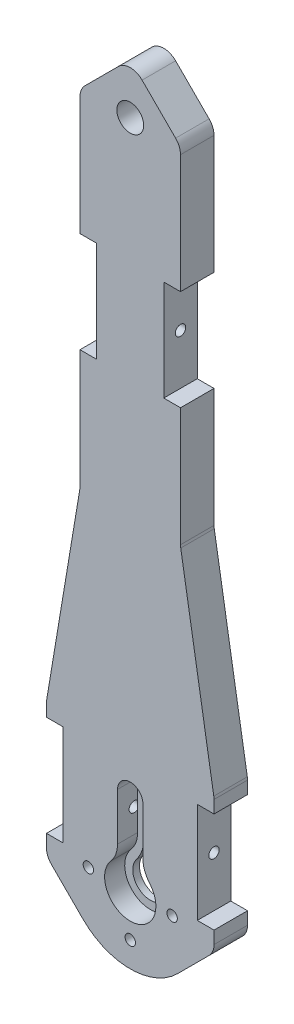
ISO-10303-21;
HEADER;
FILE_DESCRIPTION(('STEP AP214'),'2;1');
FILE_NAME('part.step','',(''),(''),'','','');
FILE_SCHEMA(('AUTOMOTIVE_DESIGN { 1 0 10303 214 1 1 1 1 }'));
ENDSEC;
DATA;
#1=APPLICATION_CONTEXT('core data for automotive mechanical design processes');
#2=APPLICATION_PROTOCOL_DEFINITION('international standard','automotive_design',2000,#1);
#3=PRODUCT_CONTEXT('',#1,'mechanical');
#4=PRODUCT('Part','Part','',(#3));
#5=PRODUCT_RELATED_PRODUCT_CATEGORY('part','',(#4));
#6=PRODUCT_DEFINITION_FORMATION('','',#4);
#7=PRODUCT_DEFINITION_CONTEXT('part definition',#1,'design');
#8=PRODUCT_DEFINITION('design','',#6,#7);
#9=PRODUCT_DEFINITION_SHAPE('','',#8);
#10=(LENGTH_UNIT() NAMED_UNIT(*) SI_UNIT(.MILLI.,.METRE.));
#11=(NAMED_UNIT(*) PLANE_ANGLE_UNIT() SI_UNIT($,.RADIAN.));
#12=(NAMED_UNIT(*) SI_UNIT($,.STERADIAN.) SOLID_ANGLE_UNIT());
#13=UNCERTAINTY_MEASURE_WITH_UNIT(LENGTH_MEASURE(1.E-05),#10,'distance_accuracy_value','');
#14=(GEOMETRIC_REPRESENTATION_CONTEXT(3) GLOBAL_UNCERTAINTY_ASSIGNED_CONTEXT((#13)) GLOBAL_UNIT_ASSIGNED_CONTEXT((#10,
#11,#12)) REPRESENTATION_CONTEXT('',''));
#15=CARTESIAN_POINT('',(0.,0.,0.));
#16=DIRECTION('',(0.,0.,1.));
#17=DIRECTION('',(1.,0.,0.));
#18=AXIS2_PLACEMENT_3D('',#15,#16,#17);
#19=CARTESIAN_POINT('',(25.,-3.28427124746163,10.));
#20=DIRECTION('',(-1.,0.,0.));
#21=DIRECTION('',(0.,-1.,0.));
#22=AXIS2_PLACEMENT_3D('',#19,#20,#21);
#23=PLANE('',#22);
#24=DIRECTION('',(0.,1.,0.));
#25=VECTOR('',#24,1.);
#26=CARTESIAN_POINT('',(25.,-3.28427124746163,10.));
#27=LINE('',#26,#25);
#28=CARTESIAN_POINT('',(25.,32.5443563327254,10.));
#29=VERTEX_POINT('',#28);
#30=CARTESIAN_POINT('',(25.,36.3019161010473,10.));
#31=VERTEX_POINT('',#30);
#32=EDGE_CURVE('E589',#29,#31,#27,.T.);
#33=ORIENTED_EDGE('',*,*,#32,.F.);
#34=DIRECTION('',(0.,0.,1.));
#35=VECTOR('',#34,1.);
#36=CARTESIAN_POINT('',(25.,32.5443563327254,0.));
#37=LINE('',#36,#35);
#38=CARTESIAN_POINT('',(25.,32.5443563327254,0.));
#39=VERTEX_POINT('',#38);
#40=EDGE_CURVE('E351',#39,#29,#37,.T.);
#41=ORIENTED_EDGE('',*,*,#40,.F.);
#42=DIRECTION('',(0.,1.,0.));
#43=VECTOR('',#42,1.);
#44=CARTESIAN_POINT('',(25.,-3.28427124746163,0.));
#45=LINE('',#44,#43);
#46=CARTESIAN_POINT('',(25.,36.3019161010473,0.));
#47=VERTEX_POINT('',#46);
#48=EDGE_CURVE('E626',#39,#47,#45,.T.);
#49=ORIENTED_EDGE('',*,*,#48,.T.);
#50=DIRECTION('',(0.,0.,-1.));
#51=VECTOR('',#50,1.);
#52=CARTESIAN_POINT('',(25.,36.3019161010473,10.));
#53=LINE('',#52,#51);
#54=EDGE_CURVE('E659',#47,#31,#53,.F.);
#55=ORIENTED_EDGE('',*,*,#54,.T.);
#56=EDGE_LOOP('',(#33,#41,#49,#55));
#57=FACE_BOUND('',#56,.T.);
#58=ADVANCED_FACE('F36',(#57),#23,.F.);
#59=CARTESIAN_POINT('',(15.,96.7157287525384,10.));
#60=DIRECTION('',(-1.,0.,0.));
#61=DIRECTION('',(0.,0.,1.));
#62=AXIS2_PLACEMENT_3D('',#59,#60,#61);
#63=PLANE('',#62);
#64=DIRECTION('',(0.,1.,0.));
#65=VECTOR('',#64,1.);
#66=CARTESIAN_POINT('',(15.,96.7157287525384,10.));
#67=LINE('',#66,#65);
#68=CARTESIAN_POINT('',(15.,162.529236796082,10.));
#69=VERTEX_POINT('',#68);
#70=CARTESIAN_POINT('',(15.,197.928932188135,10.));
#71=VERTEX_POINT('',#70);
#72=EDGE_CURVE('E592',#69,#71,#67,.T.);
#73=ORIENTED_EDGE('',*,*,#72,.F.);
#74=DIRECTION('',(0.,0.,1.));
#75=VECTOR('',#74,1.);
#76=CARTESIAN_POINT('',(15.,162.529236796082,10.));
#77=LINE('',#76,#75);
#78=CARTESIAN_POINT('',(15.,162.529236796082,0.));
#79=VERTEX_POINT('',#78);
#80=EDGE_CURVE('E500',#79,#69,#77,.T.);
#81=ORIENTED_EDGE('',*,*,#80,.F.);
#82=DIRECTION('',(0.,1.,0.));
#83=VECTOR('',#82,1.);
#84=CARTESIAN_POINT('',(15.,96.7157287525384,0.));
#85=LINE('',#84,#83);
#86=CARTESIAN_POINT('',(15.,197.928932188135,0.));
#87=VERTEX_POINT('',#86);
#88=EDGE_CURVE('E633',#79,#87,#85,.T.);
#89=ORIENTED_EDGE('',*,*,#88,.T.);
#90=DIRECTION('',(0.,0.,-1.));
#91=VECTOR('',#90,1.);
#92=CARTESIAN_POINT('',(15.,197.928932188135,10.));
#93=LINE('',#92,#91);
#94=EDGE_CURVE('E701',#87,#71,#93,.F.);
#95=ORIENTED_EDGE('',*,*,#94,.T.);
#96=EDGE_LOOP('',(#73,#81,#89,#95));
#97=FACE_BOUND('',#96,.T.);
#98=ADVANCED_FACE('F799',(#97),#63,.F.);
#99=CARTESIAN_POINT('',(0.,0.,10.));
#100=DIRECTION('',(0.,0.,1.));
#101=DIRECTION('',(1.,0.,0.));
#102=AXIS2_PLACEMENT_3D('',#99,#100,#101);
#103=PLANE('',#102);
#104=DIRECTION('',(1.,0.,0.));
#105=VECTOR('',#104,1.);
#106=CARTESIAN_POINT('',(20.,32.5443563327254,10.));
#107=LINE('',#106,#105);
#108=CARTESIAN_POINT('',(20.,32.5443563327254,10.));
#109=VERTEX_POINT('',#108);
#110=EDGE_CURVE('E539',#109,#29,#107,.T.);
#111=ORIENTED_EDGE('',*,*,#110,.T.);
#112=ORIENTED_EDGE('',*,*,#32,.T.);
#113=CARTESIAN_POINT('',(20.,36.3019161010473,10.));
#114=DIRECTION('',(0.,0.,1.));
#115=DIRECTION('',(1.,0.,0.));
#116=AXIS2_PLACEMENT_3D('',#113,#114,#115);
#117=CIRCLE('',#116,5.);
#118=CARTESIAN_POINT('',(24.9319696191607,37.1239110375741,10.));
#119=VERTEX_POINT('',#118);
#120=EDGE_CURVE('E693',#31,#119,#117,.T.);
#121=ORIENTED_EDGE('',*,*,#120,.T.);
#122=DIRECTION('',(-0.164398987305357,0.986393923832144,0.));
#123=VECTOR('',#122,1.);
#124=CARTESIAN_POINT('',(25.,36.7157287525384,10.));
#125=LINE('',#124,#123);
#126=CARTESIAN_POINT('',(15.0680303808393,96.3075464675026,10.));
#127=VERTEX_POINT('',#126);
#128=EDGE_CURVE('E588',#119,#127,#125,.T.);
#129=ORIENTED_EDGE('',*,*,#128,.T.);
#130=CARTESIAN_POINT('',(20.,97.1295414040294,10.));
#131=DIRECTION('',(0.,0.,1.));
#132=DIRECTION('',(1.,0.,0.));
#133=AXIS2_PLACEMENT_3D('',#130,#131,#132);
#134=CIRCLE('',#133,5.);
#135=CARTESIAN_POINT('',(15.,97.1295414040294,10.));
#136=VERTEX_POINT('',#135);
#137=EDGE_CURVE('E739',#127,#136,#134,.F.);
#138=ORIENTED_EDGE('',*,*,#137,.T.);
#139=CARTESIAN_POINT('',(15.,132.529236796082,10.));
#140=VERTEX_POINT('',#139);
#141=EDGE_CURVE('E598',#136,#140,#67,.T.);
#142=ORIENTED_EDGE('',*,*,#141,.T.);
#143=DIRECTION('',(1.,0.,0.));
#144=VECTOR('',#143,1.);
#145=CARTESIAN_POINT('',(10.,132.529236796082,10.));
#146=LINE('',#145,#144);
#147=CARTESIAN_POINT('',(10.,132.529236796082,10.));
#148=VERTEX_POINT('',#147);
#149=EDGE_CURVE('E490',#148,#140,#146,.T.);
#150=ORIENTED_EDGE('',*,*,#149,.F.);
#151=DIRECTION('',(0.,-1.,0.));
#152=VECTOR('',#151,1.);
#153=CARTESIAN_POINT('',(10.,132.529236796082,10.));
#154=LINE('',#153,#152);
#155=CARTESIAN_POINT('',(10.,162.529236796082,10.));
#156=VERTEX_POINT('',#155);
#157=EDGE_CURVE('E508',#156,#148,#154,.T.);
#158=ORIENTED_EDGE('',*,*,#157,.F.);
#159=DIRECTION('',(1.,0.,0.));
#160=VECTOR('',#159,1.);
#161=CARTESIAN_POINT('',(10.,162.529236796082,10.));
#162=LINE('',#161,#160);
#163=EDGE_CURVE('E487',#156,#69,#162,.T.);
#164=ORIENTED_EDGE('',*,*,#163,.T.);
#165=ORIENTED_EDGE('',*,*,#72,.T.);
#166=CARTESIAN_POINT('',(10.,197.928932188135,10.));
#167=DIRECTION('',(0.,0.,1.));
#168=DIRECTION('',(1.,0.,0.));
#169=AXIS2_PLACEMENT_3D('',#166,#167,#168);
#170=CIRCLE('',#169,5.);
#171=CARTESIAN_POINT('',(13.5355339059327,201.464466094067,10.));
#172=VERTEX_POINT('',#171);
#173=EDGE_CURVE('E683',#71,#172,#170,.T.);
#174=ORIENTED_EDGE('',*,*,#173,.T.);
#175=DIRECTION('',(-0.707106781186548,0.707106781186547,0.));
#176=VECTOR('',#175,1.);
#177=CARTESIAN_POINT('',(0.,215.,10.));
#178=LINE('',#177,#176);
#179=CARTESIAN_POINT('',(3.53553390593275,211.464466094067,10.));
#180=VERTEX_POINT('',#179);
#181=EDGE_CURVE('E601',#172,#180,#178,.T.);
#182=ORIENTED_EDGE('',*,*,#181,.T.);
#183=CARTESIAN_POINT('',(0.,207.928932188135,10.));
#184=DIRECTION('',(0.,0.,1.));
#185=DIRECTION('',(1.,0.,0.));
#186=AXIS2_PLACEMENT_3D('',#183,#184,#185);
#187=CIRCLE('',#186,5.);
#188=CARTESIAN_POINT('',(-3.53553390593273,211.464466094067,10.));
#189=VERTEX_POINT('',#188);
#190=EDGE_CURVE('E689',#180,#189,#187,.T.);
#191=ORIENTED_EDGE('',*,*,#190,.T.);
#192=DIRECTION('',(-0.707106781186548,-0.707106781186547,0.));
#193=VECTOR('',#192,1.);
#194=CARTESIAN_POINT('',(-15.,200.,10.));
#195=LINE('',#194,#193);
#196=CARTESIAN_POINT('',(-13.5355339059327,201.464466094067,10.));
#197=VERTEX_POINT('',#196);
#198=EDGE_CURVE('E604',#189,#197,#195,.T.);
#199=ORIENTED_EDGE('',*,*,#198,.T.);
#200=CARTESIAN_POINT('',(-10.,197.928932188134,10.));
#201=DIRECTION('',(0.,0.,1.));
#202=DIRECTION('',(1.,0.,0.));
#203=AXIS2_PLACEMENT_3D('',#200,#201,#202);
#204=CIRCLE('',#203,5.);
#205=CARTESIAN_POINT('',(-15.,197.928932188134,10.));
#206=VERTEX_POINT('',#205);
#207=EDGE_CURVE('E691',#197,#206,#204,.T.);
#208=ORIENTED_EDGE('',*,*,#207,.T.);
#209=DIRECTION('',(0.,-1.,0.));
#210=VECTOR('',#209,1.);
#211=CARTESIAN_POINT('',(-15.,96.7157287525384,10.));
#212=LINE('',#211,#210);
#213=CARTESIAN_POINT('',(-15.,162.529236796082,10.));
#214=VERTEX_POINT('',#213);
#215=EDGE_CURVE('E608',#206,#214,#212,.T.);
#216=ORIENTED_EDGE('',*,*,#215,.T.);
#217=DIRECTION('',(-1.,0.,0.));
#218=VECTOR('',#217,1.);
#219=CARTESIAN_POINT('',(-10.,162.529236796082,10.));
#220=LINE('',#219,#218);
#221=CARTESIAN_POINT('',(-10.,162.529236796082,10.));
#222=VERTEX_POINT('',#221);
#223=EDGE_CURVE('E467',#222,#214,#220,.T.);
#224=ORIENTED_EDGE('',*,*,#223,.F.);
#225=DIRECTION('',(0.,1.,0.));
#226=VECTOR('',#225,1.);
#227=CARTESIAN_POINT('',(-10.,0.,10.));
#228=LINE('',#227,#226);
#229=CARTESIAN_POINT('',(-10.,132.529236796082,10.));
#230=VERTEX_POINT('',#229);
#231=EDGE_CURVE('E479',#230,#222,#228,.T.);
#232=ORIENTED_EDGE('',*,*,#231,.F.);
#233=DIRECTION('',(-1.,0.,0.));
#234=VECTOR('',#233,1.);
#235=CARTESIAN_POINT('',(-10.,132.529236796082,10.));
#236=LINE('',#235,#234);
#237=CARTESIAN_POINT('',(-15.,132.529236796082,10.));
#238=VERTEX_POINT('',#237);
#239=EDGE_CURVE('E463',#230,#238,#236,.T.);
#240=ORIENTED_EDGE('',*,*,#239,.T.);
#241=CARTESIAN_POINT('',(-15.,97.1295414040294,10.));
#242=VERTEX_POINT('',#241);
#243=EDGE_CURVE('E607',#238,#242,#212,.T.);
#244=ORIENTED_EDGE('',*,*,#243,.T.);
#245=CARTESIAN_POINT('',(-20.,97.1295414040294,10.));
#246=DIRECTION('',(0.,0.,1.));
#247=DIRECTION('',(1.,0.,0.));
#248=AXIS2_PLACEMENT_3D('',#245,#246,#247);
#249=CIRCLE('',#248,5.);
#250=CARTESIAN_POINT('',(-15.0680303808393,96.3075464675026,10.));
#251=VERTEX_POINT('',#250);
#252=EDGE_CURVE('E11',#242,#251,#249,.F.);
#253=ORIENTED_EDGE('',*,*,#252,.T.);
#254=DIRECTION('',(-0.164398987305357,-0.986393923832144,0.));
#255=VECTOR('',#254,1.);
#256=CARTESIAN_POINT('',(-25.,36.7157287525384,10.));
#257=LINE('',#256,#255);
#258=CARTESIAN_POINT('',(-24.9319696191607,37.1239110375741,10.));
#259=VERTEX_POINT('',#258);
#260=EDGE_CURVE('E611',#251,#259,#257,.T.);
#261=ORIENTED_EDGE('',*,*,#260,.T.);
#262=CARTESIAN_POINT('',(-20.,36.3019161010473,10.));
#263=DIRECTION('',(0.,0.,1.));
#264=DIRECTION('',(1.,0.,0.));
#265=AXIS2_PLACEMENT_3D('',#262,#263,#264);
#266=CIRCLE('',#265,5.);
#267=CARTESIAN_POINT('',(-25.,36.3019161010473,10.));
#268=VERTEX_POINT('',#267);
#269=EDGE_CURVE('E687',#259,#268,#266,.T.);
#270=ORIENTED_EDGE('',*,*,#269,.T.);
#271=DIRECTION('',(0.,-1.,0.));
#272=VECTOR('',#271,1.);
#273=CARTESIAN_POINT('',(-25.,-3.28427124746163,10.));
#274=LINE('',#273,#272);
#275=CARTESIAN_POINT('',(-25.,32.5443563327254,10.));
#276=VERTEX_POINT('',#275);
#277=EDGE_CURVE('E910',#268,#276,#274,.T.);
#278=ORIENTED_EDGE('',*,*,#277,.T.);
#279=DIRECTION('',(-1.,0.,0.));
#280=VECTOR('',#279,1.);
#281=CARTESIAN_POINT('',(-20.,32.5443563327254,10.));
#282=LINE('',#281,#280);
#283=CARTESIAN_POINT('',(-20.,32.5443563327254,10.));
#284=VERTEX_POINT('',#283);
#285=EDGE_CURVE('E441',#284,#276,#282,.T.);
#286=ORIENTED_EDGE('',*,*,#285,.F.);
#287=DIRECTION('',(0.,1.,0.));
#288=VECTOR('',#287,1.);
#289=CARTESIAN_POINT('',(-20.,0.,10.));
#290=LINE('',#289,#288);
#291=CARTESIAN_POINT('',(-20.,2.54435633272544,10.));
#292=VERTEX_POINT('',#291);
#293=EDGE_CURVE('E453',#292,#284,#290,.T.);
#294=ORIENTED_EDGE('',*,*,#293,.F.);
#295=DIRECTION('',(-1.,0.,0.));
#296=VECTOR('',#295,1.);
#297=CARTESIAN_POINT('',(-20.,2.54435633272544,10.));
#298=LINE('',#297,#296);
#299=CARTESIAN_POINT('',(-25.,2.54435633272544,10.));
#300=VERTEX_POINT('',#299);
#301=EDGE_CURVE('E437',#292,#300,#298,.T.);
#302=ORIENTED_EDGE('',*,*,#301,.T.);
#303=CARTESIAN_POINT('',(-25.,-1.21320343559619,10.));
#304=VERTEX_POINT('',#303);
#305=EDGE_CURVE('E650',#300,#304,#274,.T.);
#306=ORIENTED_EDGE('',*,*,#305,.T.);
#307=CARTESIAN_POINT('',(-20.,-1.21320343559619,10.));
#308=DIRECTION('',(0.,0.,1.));
#309=DIRECTION('',(1.,0.,0.));
#310=AXIS2_PLACEMENT_3D('',#307,#308,#309);
#311=CIRCLE('',#310,5.);
#312=CARTESIAN_POINT('',(-23.5355339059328,-4.74873734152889,10.));
#313=VERTEX_POINT('',#312);
#314=EDGE_CURVE('E685',#304,#313,#311,.T.);
#315=ORIENTED_EDGE('',*,*,#314,.T.);
#316=DIRECTION('',(0.707106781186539,-0.707106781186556,0.));
#317=VECTOR('',#316,1.);
#318=CARTESIAN_POINT('',(-14.142135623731,-14.1421356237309,10.));
#319=LINE('',#318,#317);
#320=CARTESIAN_POINT('',(-14.142135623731,-14.1421356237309,10.));
#321=VERTEX_POINT('',#320);
#322=EDGE_CURVE('E902',#313,#321,#319,.T.);
#323=ORIENTED_EDGE('',*,*,#322,.T.);
#324=CARTESIAN_POINT('',(0.,0.,10.));
#325=DIRECTION('',(0.,0.,1.));
#326=DIRECTION('',(1.,0.,0.));
#327=AXIS2_PLACEMENT_3D('',#324,#325,#326);
#328=CIRCLE('',#327,20.);
#329=CARTESIAN_POINT('',(14.142135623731,-14.1421356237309,10.));
#330=VERTEX_POINT('',#329);
#331=EDGE_CURVE('E909',#321,#330,#328,.T.);
#332=ORIENTED_EDGE('',*,*,#331,.T.);
#333=DIRECTION('',(0.707106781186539,0.707106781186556,0.));
#334=VECTOR('',#333,1.);
#335=CARTESIAN_POINT('',(14.142135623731,-14.1421356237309,10.));
#336=LINE('',#335,#334);
#337=CARTESIAN_POINT('',(23.5355339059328,-4.74873734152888,10.));
#338=VERTEX_POINT('',#337);
#339=EDGE_CURVE('E594',#330,#338,#336,.T.);
#340=ORIENTED_EDGE('',*,*,#339,.T.);
#341=CARTESIAN_POINT('',(20.,-1.21320343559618,10.));
#342=DIRECTION('',(0.,0.,1.));
#343=DIRECTION('',(1.,0.,0.));
#344=AXIS2_PLACEMENT_3D('',#341,#342,#343);
#345=CIRCLE('',#344,5.);
#346=CARTESIAN_POINT('',(25.,-1.21320343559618,10.));
#347=VERTEX_POINT('',#346);
#348=EDGE_CURVE('E584',#338,#347,#345,.T.);
#349=ORIENTED_EDGE('',*,*,#348,.T.);
#350=CARTESIAN_POINT('',(25.,2.54435633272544,10.));
#351=VERTEX_POINT('',#350);
#352=EDGE_CURVE('E581',#347,#351,#27,.T.);
#353=ORIENTED_EDGE('',*,*,#352,.T.);
#354=DIRECTION('',(1.,0.,0.));
#355=VECTOR('',#354,1.);
#356=CARTESIAN_POINT('',(20.,2.54435633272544,10.));
#357=LINE('',#356,#355);
#358=CARTESIAN_POINT('',(20.,2.54435633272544,10.));
#359=VERTEX_POINT('',#358);
#360=EDGE_CURVE('E59',#359,#351,#357,.T.);
#361=ORIENTED_EDGE('',*,*,#360,.F.);
#362=DIRECTION('',(0.,-1.,0.));
#363=VECTOR('',#362,1.);
#364=CARTESIAN_POINT('',(20.,32.5443563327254,10.));
#365=LINE('',#364,#363);
#366=EDGE_CURVE('E557',#109,#359,#365,.T.);
#367=ORIENTED_EDGE('',*,*,#366,.F.);
#368=EDGE_LOOP('',(#111,#112,#121,#129,#138,#142,#150,#158,#164,#165,#174,#182,#191,#199,#208,
#216,#224,#232,#240,#244,#253,#261,#270,#278,#286,#294,#302,#306,#315,#323,#332,#340,#349,#353,
#361,#367));
#369=FACE_BOUND('',#368,.T.);
#370=CARTESIAN_POINT('',(-11.9870129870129,10.35,10.));
#371=DIRECTION('',(0.,0.,-1.));
#372=DIRECTION('',(-1.,0.,0.));
#373=AXIS2_PLACEMENT_3D('',#370,#371,#372);
#374=CIRCLE('',#373,8.18701298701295);
#375=CARTESIAN_POINT('',(-3.8,10.35,10.));
#376=VERTEX_POINT('',#375);
#377=CARTESIAN_POINT('',(-5.7902743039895,4.99952232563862,10.));
#378=VERTEX_POINT('',#377);
#379=EDGE_CURVE('E530',#376,#378,#374,.T.);
#380=ORIENTED_EDGE('',*,*,#379,.F.);
#381=DIRECTION('',(0.,-1.,0.));
#382=VECTOR('',#381,1.);
#383=CARTESIAN_POINT('',(-3.8,10.35,10.));
#384=LINE('',#383,#382);
#385=CARTESIAN_POINT('',(-3.8,24.5,10.));
#386=VERTEX_POINT('',#385);
#387=EDGE_CURVE('E933',#386,#376,#384,.T.);
#388=ORIENTED_EDGE('',*,*,#387,.F.);
#389=CARTESIAN_POINT('',(0.,24.5,10.));
#390=DIRECTION('',(0.,0.,1.));
#391=DIRECTION('',(1.,0.,0.));
#392=AXIS2_PLACEMENT_3D('',#389,#390,#391);
#393=CIRCLE('',#392,3.8);
#394=CARTESIAN_POINT('',(3.8,24.5,10.));
#395=VERTEX_POINT('',#394);
#396=EDGE_CURVE('E936',#395,#386,#393,.T.);
#397=ORIENTED_EDGE('',*,*,#396,.F.);
#398=DIRECTION('',(0.,1.,0.));
#399=VECTOR('',#398,1.);
#400=CARTESIAN_POINT('',(3.8,24.5,10.));
#401=LINE('',#400,#399);
#402=CARTESIAN_POINT('',(3.8,10.35,10.));
#403=VERTEX_POINT('',#402);
#404=EDGE_CURVE('E931',#403,#395,#401,.T.);
#405=ORIENTED_EDGE('',*,*,#404,.F.);
#406=CARTESIAN_POINT('',(11.9870129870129,10.35,10.));
#407=DIRECTION('',(0.,0.,-1.));
#408=DIRECTION('',(1.,0.,0.));
#409=AXIS2_PLACEMENT_3D('',#406,#407,#408);
#410=CIRCLE('',#409,8.18701298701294);
#411=CARTESIAN_POINT('',(5.7902743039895,4.99952232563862,10.));
#412=VERTEX_POINT('',#411);
#413=EDGE_CURVE('E524',#412,#403,#410,.T.);
#414=ORIENTED_EDGE('',*,*,#413,.F.);
#415=CARTESIAN_POINT('',(0.,0.,10.));
#416=DIRECTION('',(0.,0.,1.));
#417=DIRECTION('',(1.,0.,0.));
#418=AXIS2_PLACEMENT_3D('',#415,#416,#417);
#419=CIRCLE('',#418,7.65);
#420=EDGE_CURVE('E527',#378,#412,#419,.T.);
#421=ORIENTED_EDGE('',*,*,#420,.F.);
#422=EDGE_LOOP('',(#380,#388,#397,#405,#414,#421));
#423=FACE_BOUND('',#422,.T.);
#424=CARTESIAN_POINT('',(12.5,0.,10.));
#425=DIRECTION('',(0.,0.,-1.));
#426=DIRECTION('',(-1.,0.,0.));
#427=AXIS2_PLACEMENT_3D('',#424,#425,#426);
#428=CIRCLE('',#427,1.55);
#429=CARTESIAN_POINT('',(10.95,0.,10.));
#430=VERTEX_POINT('',#429);
#431=EDGE_CURVE('E416',#430,#430,#428,.T.);
#432=ORIENTED_EDGE('',*,*,#431,.T.);
#433=EDGE_LOOP('',(#432));
#434=FACE_BOUND('',#433,.T.);
#435=CARTESIAN_POINT('',(0.,-12.5,10.));
#436=DIRECTION('',(0.,0.,-1.));
#437=DIRECTION('',(-1.,0.,0.));
#438=AXIS2_PLACEMENT_3D('',#435,#436,#437);
#439=CIRCLE('',#438,1.55);
#440=CARTESIAN_POINT('',(-1.55,-12.5,10.));
#441=VERTEX_POINT('',#440);
#442=EDGE_CURVE('E424',#441,#441,#439,.T.);
#443=ORIENTED_EDGE('',*,*,#442,.T.);
#444=EDGE_LOOP('',(#443));
#445=FACE_BOUND('',#444,.T.);
#446=CARTESIAN_POINT('',(-12.5,0.,10.));
#447=DIRECTION('',(0.,0.,-1.));
#448=DIRECTION('',(-1.,0.,0.));
#449=AXIS2_PLACEMENT_3D('',#446,#447,#448);
#450=CIRCLE('',#449,1.55);
#451=CARTESIAN_POINT('',(-14.05,0.,10.));
#452=VERTEX_POINT('',#451);
#453=EDGE_CURVE('E417',#452,#452,#450,.T.);
#454=ORIENTED_EDGE('',*,*,#453,.T.);
#455=EDGE_LOOP('',(#454));
#456=FACE_BOUND('',#455,.T.);
#457=CARTESIAN_POINT('',(0.,200.,10.));
#458=DIRECTION('',(0.,0.,1.));
#459=DIRECTION('',(1.,0.,0.));
#460=AXIS2_PLACEMENT_3D('',#457,#458,#459);
#461=CIRCLE('',#460,4.);
#462=CARTESIAN_POINT('',(4.,200.,10.));
#463=VERTEX_POINT('',#462);
#464=EDGE_CURVE('E918',#463,#463,#461,.T.);
#465=ORIENTED_EDGE('',*,*,#464,.F.);
#466=EDGE_LOOP('',(#465));
#467=FACE_BOUND('',#466,.T.);
#468=ADVANCED_FACE('F576',(#369,#423,#434,#445,#456,#467),#103,.T.);
#469=CARTESIAN_POINT('',(0.,0.,0.));
#470=DIRECTION('',(0.,0.,1.));
#471=DIRECTION('',(1.,0.,0.));
#472=AXIS2_PLACEMENT_3D('',#469,#470,#471);
#473=PLANE('',#472);
#474=ORIENTED_EDGE('',*,*,#48,.F.);
#475=DIRECTION('',(1.,0.,0.));
#476=VECTOR('',#475,1.);
#477=CARTESIAN_POINT('',(20.,32.5443563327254,0.));
#478=LINE('',#477,#476);
#479=CARTESIAN_POINT('',(20.,32.5443563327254,0.));
#480=VERTEX_POINT('',#479);
#481=EDGE_CURVE('E538',#480,#39,#478,.T.);
#482=ORIENTED_EDGE('',*,*,#481,.F.);
#483=DIRECTION('',(0.,1.,0.));
#484=VECTOR('',#483,1.);
#485=CARTESIAN_POINT('',(20.,2.54435633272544,0.));
#486=LINE('',#485,#484);
#487=CARTESIAN_POINT('',(20.,2.54435633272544,0.));
#488=VERTEX_POINT('',#487);
#489=EDGE_CURVE('E542',#488,#480,#486,.T.);
#490=ORIENTED_EDGE('',*,*,#489,.F.);
#491=DIRECTION('',(1.,0.,0.));
#492=VECTOR('',#491,1.);
#493=CARTESIAN_POINT('',(20.,2.54435633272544,0.));
#494=LINE('',#493,#492);
#495=CARTESIAN_POINT('',(25.,2.54435633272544,0.));
#496=VERTEX_POINT('',#495);
#497=EDGE_CURVE('E544',#488,#496,#494,.T.);
#498=ORIENTED_EDGE('',*,*,#497,.T.);
#499=CARTESIAN_POINT('',(25.,-1.21320343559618,0.));
#500=VERTEX_POINT('',#499);
#501=EDGE_CURVE('E627',#500,#496,#45,.T.);
#502=ORIENTED_EDGE('',*,*,#501,.F.);
#503=CARTESIAN_POINT('',(20.,-1.21320343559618,0.));
#504=DIRECTION('',(0.,0.,1.));
#505=DIRECTION('',(1.,0.,0.));
#506=AXIS2_PLACEMENT_3D('',#503,#504,#505);
#507=CIRCLE('',#506,5.);
#508=CARTESIAN_POINT('',(23.5355339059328,-4.74873734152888,0.));
#509=VERTEX_POINT('',#508);
#510=EDGE_CURVE('E679',#500,#509,#507,.F.);
#511=ORIENTED_EDGE('',*,*,#510,.T.);
#512=DIRECTION('',(0.707106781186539,0.707106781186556,0.));
#513=VECTOR('',#512,1.);
#514=CARTESIAN_POINT('',(14.142135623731,-14.1421356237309,0.));
#515=LINE('',#514,#513);
#516=CARTESIAN_POINT('',(14.142135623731,-14.1421356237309,0.));
#517=VERTEX_POINT('',#516);
#518=EDGE_CURVE('E623',#517,#509,#515,.T.);
#519=ORIENTED_EDGE('',*,*,#518,.F.);
#520=CARTESIAN_POINT('',(0.,0.,0.));
#521=DIRECTION('',(0.,0.,1.));
#522=DIRECTION('',(1.,0.,0.));
#523=AXIS2_PLACEMENT_3D('',#520,#521,#522);
#524=CIRCLE('',#523,20.);
#525=CARTESIAN_POINT('',(-14.142135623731,-14.1421356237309,0.));
#526=VERTEX_POINT('',#525);
#527=EDGE_CURVE('E621',#526,#517,#524,.T.);
#528=ORIENTED_EDGE('',*,*,#527,.F.);
#529=DIRECTION('',(0.707106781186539,-0.707106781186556,0.));
#530=VECTOR('',#529,1.);
#531=CARTESIAN_POINT('',(-14.142135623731,-14.1421356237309,0.));
#532=LINE('',#531,#530);
#533=CARTESIAN_POINT('',(-23.5355339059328,-4.74873734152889,0.));
#534=VERTEX_POINT('',#533);
#535=EDGE_CURVE('E618',#534,#526,#532,.T.);
#536=ORIENTED_EDGE('',*,*,#535,.F.);
#537=CARTESIAN_POINT('',(-20.,-1.21320343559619,0.));
#538=DIRECTION('',(0.,0.,1.));
#539=DIRECTION('',(1.,0.,0.));
#540=AXIS2_PLACEMENT_3D('',#537,#538,#539);
#541=CIRCLE('',#540,5.);
#542=CARTESIAN_POINT('',(-25.,-1.21320343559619,0.));
#543=VERTEX_POINT('',#542);
#544=EDGE_CURVE('E667',#534,#543,#541,.F.);
#545=ORIENTED_EDGE('',*,*,#544,.T.);
#546=DIRECTION('',(0.,-1.,0.));
#547=VECTOR('',#546,1.);
#548=CARTESIAN_POINT('',(-25.,-3.28427124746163,0.));
#549=LINE('',#548,#547);
#550=CARTESIAN_POINT('',(-25.,2.54435633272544,0.));
#551=VERTEX_POINT('',#550);
#552=EDGE_CURVE('E619',#551,#543,#549,.T.);
#553=ORIENTED_EDGE('',*,*,#552,.F.);
#554=DIRECTION('',(-1.,0.,0.));
#555=VECTOR('',#554,1.);
#556=CARTESIAN_POINT('',(-20.,2.54435633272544,0.));
#557=LINE('',#556,#555);
#558=CARTESIAN_POINT('',(-20.,2.54435633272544,0.));
#559=VERTEX_POINT('',#558);
#560=EDGE_CURVE('E435',#559,#551,#557,.T.);
#561=ORIENTED_EDGE('',*,*,#560,.F.);
#562=DIRECTION('',(0.,-1.,0.));
#563=VECTOR('',#562,1.);
#564=CARTESIAN_POINT('',(-20.,0.,0.));
#565=LINE('',#564,#563);
#566=CARTESIAN_POINT('',(-20.,32.5443563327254,0.));
#567=VERTEX_POINT('',#566);
#568=EDGE_CURVE('E448',#567,#559,#565,.T.);
#569=ORIENTED_EDGE('',*,*,#568,.F.);
#570=DIRECTION('',(-1.,0.,0.));
#571=VECTOR('',#570,1.);
#572=CARTESIAN_POINT('',(-20.,32.5443563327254,0.));
#573=LINE('',#572,#571);
#574=CARTESIAN_POINT('',(-25.,32.5443563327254,0.));
#575=VERTEX_POINT('',#574);
#576=EDGE_CURVE('E421',#567,#575,#573,.T.);
#577=ORIENTED_EDGE('',*,*,#576,.T.);
#578=CARTESIAN_POINT('',(-25.,36.3019161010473,0.));
#579=VERTEX_POINT('',#578);
#580=EDGE_CURVE('E615',#579,#575,#549,.T.);
#581=ORIENTED_EDGE('',*,*,#580,.F.);
#582=CARTESIAN_POINT('',(-20.,36.3019161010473,0.));
#583=DIRECTION('',(0.,0.,1.));
#584=DIRECTION('',(1.,0.,0.));
#585=AXIS2_PLACEMENT_3D('',#582,#583,#584);
#586=CIRCLE('',#585,5.);
#587=CARTESIAN_POINT('',(-24.9319696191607,37.1239110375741,0.));
#588=VERTEX_POINT('',#587);
#589=EDGE_CURVE('E670',#579,#588,#586,.F.);
#590=ORIENTED_EDGE('',*,*,#589,.T.);
#591=DIRECTION('',(-0.164398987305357,-0.986393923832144,0.));
#592=VECTOR('',#591,1.);
#593=CARTESIAN_POINT('',(-25.,36.7157287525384,0.));
#594=LINE('',#593,#592);
#595=CARTESIAN_POINT('',(-15.0680303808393,96.3075464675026,0.));
#596=VERTEX_POINT('',#595);
#597=EDGE_CURVE('E647',#596,#588,#594,.T.);
#598=ORIENTED_EDGE('',*,*,#597,.F.);
#599=CARTESIAN_POINT('',(-20.,97.1295414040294,0.));
#600=DIRECTION('',(0.,0.,1.));
#601=DIRECTION('',(1.,0.,0.));
#602=AXIS2_PLACEMENT_3D('',#599,#600,#601);
#603=CIRCLE('',#602,5.);
#604=CARTESIAN_POINT('',(-15.,97.1295414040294,0.));
#605=VERTEX_POINT('',#604);
#606=EDGE_CURVE('E45',#596,#605,#603,.T.);
#607=ORIENTED_EDGE('',*,*,#606,.T.);
#608=DIRECTION('',(0.,-1.,0.));
#609=VECTOR('',#608,1.);
#610=CARTESIAN_POINT('',(-15.,96.7157287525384,0.));
#611=LINE('',#610,#609);
#612=CARTESIAN_POINT('',(-15.,132.529236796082,0.));
#613=VERTEX_POINT('',#612);
#614=EDGE_CURVE('E643',#613,#605,#611,.T.);
#615=ORIENTED_EDGE('',*,*,#614,.F.);
#616=DIRECTION('',(-1.,0.,0.));
#617=VECTOR('',#616,1.);
#618=CARTESIAN_POINT('',(-10.,132.529236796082,0.));
#619=LINE('',#618,#617);
#620=CARTESIAN_POINT('',(-10.,132.529236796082,0.));
#621=VERTEX_POINT('',#620);
#622=EDGE_CURVE('E461',#621,#613,#619,.T.);
#623=ORIENTED_EDGE('',*,*,#622,.F.);
#624=DIRECTION('',(0.,-1.,0.));
#625=VECTOR('',#624,1.);
#626=CARTESIAN_POINT('',(-10.,0.,0.));
#627=LINE('',#626,#625);
#628=CARTESIAN_POINT('',(-10.,162.529236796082,0.));
#629=VERTEX_POINT('',#628);
#630=EDGE_CURVE('E474',#629,#621,#627,.T.);
#631=ORIENTED_EDGE('',*,*,#630,.F.);
#632=DIRECTION('',(-1.,0.,0.));
#633=VECTOR('',#632,1.);
#634=CARTESIAN_POINT('',(-10.,162.529236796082,0.));
#635=LINE('',#634,#633);
#636=CARTESIAN_POINT('',(-15.,162.529236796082,0.));
#637=VERTEX_POINT('',#636);
#638=EDGE_CURVE('E451',#629,#637,#635,.T.);
#639=ORIENTED_EDGE('',*,*,#638,.T.);
#640=CARTESIAN_POINT('',(-15.,197.928932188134,0.));
#641=VERTEX_POINT('',#640);
#642=EDGE_CURVE('E644',#641,#637,#611,.T.);
#643=ORIENTED_EDGE('',*,*,#642,.F.);
#644=CARTESIAN_POINT('',(-10.,197.928932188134,0.));
#645=DIRECTION('',(0.,0.,1.));
#646=DIRECTION('',(1.,0.,0.));
#647=AXIS2_PLACEMENT_3D('',#644,#645,#646);
#648=CIRCLE('',#647,5.);
#649=CARTESIAN_POINT('',(-13.5355339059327,201.464466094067,0.));
#650=VERTEX_POINT('',#649);
#651=EDGE_CURVE('E674',#641,#650,#648,.F.);
#652=ORIENTED_EDGE('',*,*,#651,.T.);
#653=DIRECTION('',(-0.707106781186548,-0.707106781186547,0.));
#654=VECTOR('',#653,1.);
#655=CARTESIAN_POINT('',(-15.,200.,0.));
#656=LINE('',#655,#654);
#657=CARTESIAN_POINT('',(-3.53553390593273,211.464466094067,0.));
#658=VERTEX_POINT('',#657);
#659=EDGE_CURVE('E640',#658,#650,#656,.T.);
#660=ORIENTED_EDGE('',*,*,#659,.F.);
#661=CARTESIAN_POINT('',(0.,207.928932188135,0.));
#662=DIRECTION('',(0.,0.,1.));
#663=DIRECTION('',(1.,0.,0.));
#664=AXIS2_PLACEMENT_3D('',#661,#662,#663);
#665=CIRCLE('',#664,5.);
#666=CARTESIAN_POINT('',(3.53553390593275,211.464466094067,0.));
#667=VERTEX_POINT('',#666);
#668=EDGE_CURVE('E672',#658,#667,#665,.F.);
#669=ORIENTED_EDGE('',*,*,#668,.T.);
#670=DIRECTION('',(-0.707106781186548,0.707106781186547,0.));
#671=VECTOR('',#670,1.);
#672=CARTESIAN_POINT('',(0.,215.,0.));
#673=LINE('',#672,#671);
#674=CARTESIAN_POINT('',(13.5355339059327,201.464466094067,0.));
#675=VERTEX_POINT('',#674);
#676=EDGE_CURVE('E637',#675,#667,#673,.T.);
#677=ORIENTED_EDGE('',*,*,#676,.F.);
#678=CARTESIAN_POINT('',(10.,197.928932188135,0.));
#679=DIRECTION('',(0.,0.,1.));
#680=DIRECTION('',(1.,0.,0.));
#681=AXIS2_PLACEMENT_3D('',#678,#679,#680);
#682=CIRCLE('',#681,5.);
#683=EDGE_CURVE('E664',#675,#87,#682,.F.);
#684=ORIENTED_EDGE('',*,*,#683,.T.);
#685=ORIENTED_EDGE('',*,*,#88,.F.);
#686=DIRECTION('',(1.,0.,0.));
#687=VECTOR('',#686,1.);
#688=CARTESIAN_POINT('',(10.,162.529236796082,0.));
#689=LINE('',#688,#687);
#690=CARTESIAN_POINT('',(10.,162.529236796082,0.));
#691=VERTEX_POINT('',#690);
#692=EDGE_CURVE('E477',#691,#79,#689,.T.);
#693=ORIENTED_EDGE('',*,*,#692,.F.);
#694=DIRECTION('',(0.,1.,0.));
#695=VECTOR('',#694,1.);
#696=CARTESIAN_POINT('',(10.,162.529236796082,0.));
#697=LINE('',#696,#695);
#698=CARTESIAN_POINT('',(10.,132.529236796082,0.));
#699=VERTEX_POINT('',#698);
#700=EDGE_CURVE('E491',#699,#691,#697,.T.);
#701=ORIENTED_EDGE('',*,*,#700,.F.);
#702=DIRECTION('',(1.,0.,0.));
#703=VECTOR('',#702,1.);
#704=CARTESIAN_POINT('',(10.,132.529236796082,0.));
#705=LINE('',#704,#703);
#706=CARTESIAN_POINT('',(15.,132.529236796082,0.));
#707=VERTEX_POINT('',#706);
#708=EDGE_CURVE('E493',#699,#707,#705,.T.);
#709=ORIENTED_EDGE('',*,*,#708,.T.);
#710=CARTESIAN_POINT('',(15.,97.1295414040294,0.));
#711=VERTEX_POINT('',#710);
#712=EDGE_CURVE('E634',#711,#707,#85,.T.);
#713=ORIENTED_EDGE('',*,*,#712,.F.);
#714=CARTESIAN_POINT('',(20.,97.1295414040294,0.));
#715=DIRECTION('',(0.,0.,1.));
#716=DIRECTION('',(1.,0.,0.));
#717=AXIS2_PLACEMENT_3D('',#714,#715,#716);
#718=CIRCLE('',#717,5.);
#719=CARTESIAN_POINT('',(15.0680303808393,96.3075464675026,0.));
#720=VERTEX_POINT('',#719);
#721=EDGE_CURVE('E737',#711,#720,#718,.T.);
#722=ORIENTED_EDGE('',*,*,#721,.T.);
#723=DIRECTION('',(-0.164398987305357,0.986393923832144,0.));
#724=VECTOR('',#723,1.);
#725=CARTESIAN_POINT('',(25.,36.7157287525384,0.));
#726=LINE('',#725,#724);
#727=CARTESIAN_POINT('',(24.9319696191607,37.1239110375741,0.));
#728=VERTEX_POINT('',#727);
#729=EDGE_CURVE('E630',#728,#720,#726,.T.);
#730=ORIENTED_EDGE('',*,*,#729,.F.);
#731=CARTESIAN_POINT('',(20.,36.3019161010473,0.));
#732=DIRECTION('',(0.,0.,1.));
#733=DIRECTION('',(1.,0.,0.));
#734=AXIS2_PLACEMENT_3D('',#731,#732,#733);
#735=CIRCLE('',#734,5.);
#736=EDGE_CURVE('E676',#728,#47,#735,.F.);
#737=ORIENTED_EDGE('',*,*,#736,.T.);
#738=EDGE_LOOP('',(#474,#482,#490,#498,#502,#511,#519,#528,#536,#545,#553,#561,#569,#577,#581,
#590,#598,#607,#615,#623,#631,#639,#643,#652,#660,#669,#677,#684,#685,#693,#701,#709,#713,#722,
#730,#737));
#739=FACE_BOUND('',#738,.T.);
#740=CARTESIAN_POINT('',(-1.25596148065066E-10,3.26908639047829E-11,0.));
#741=DIRECTION('',(0.,0.,-1.));
#742=DIRECTION('',(-1.,0.,0.));
#743=AXIS2_PLACEMENT_3D('',#740,#741,#742);
#744=CIRCLE('',#743,15.);
#745=CARTESIAN_POINT('',(-15.0000000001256,3.26908639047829E-11,0.));
#746=VERTEX_POINT('',#745);
#747=EDGE_CURVE('E408',#746,#746,#744,.T.);
#748=ORIENTED_EDGE('',*,*,#747,.F.);
#749=EDGE_LOOP('',(#748));
#750=FACE_BOUND('',#749,.T.);
#751=CARTESIAN_POINT('',(0.,200.,0.));
#752=DIRECTION('',(0.,0.,1.));
#753=DIRECTION('',(1.,0.,0.));
#754=AXIS2_PLACEMENT_3D('',#751,#752,#753);
#755=CIRCLE('',#754,4.);
#756=CARTESIAN_POINT('',(4.,200.,0.));
#757=VERTEX_POINT('',#756);
#758=EDGE_CURVE('E915',#757,#757,#755,.T.);
#759=ORIENTED_EDGE('',*,*,#758,.T.);
#760=EDGE_LOOP('',(#759));
#761=FACE_BOUND('',#760,.T.);
#762=CARTESIAN_POINT('',(0.,20.5,0.));
#763=DIRECTION('',(0.,0.,1.));
#764=DIRECTION('',(1.,0.,0.));
#765=AXIS2_PLACEMENT_3D('',#762,#763,#764);
#766=CIRCLE('',#765,1.55000000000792);
#767=CARTESIAN_POINT('',(1.55000000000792,20.5,0.));
#768=VERTEX_POINT('',#767);
#769=EDGE_CURVE('E379',#768,#768,#766,.T.);
#770=ORIENTED_EDGE('',*,*,#769,.T.);
#771=EDGE_LOOP('',(#770));
#772=FACE_BOUND('',#771,.T.);
#773=CARTESIAN_POINT('',(0.,24.5,0.));
#774=DIRECTION('',(0.,0.,1.));
#775=DIRECTION('',(1.,0.,0.));
#776=AXIS2_PLACEMENT_3D('',#773,#774,#775);
#777=CIRCLE('',#776,1.55);
#778=CARTESIAN_POINT('',(1.55,24.5,0.));
#779=VERTEX_POINT('',#778);
#780=EDGE_CURVE('E372',#779,#779,#777,.T.);
#781=ORIENTED_EDGE('',*,*,#780,.T.);
#782=EDGE_LOOP('',(#781));
#783=FACE_BOUND('',#782,.T.);
#784=ADVANCED_FACE('F747',(#739,#750,#761,#772,#783),#473,.F.);
#785=CARTESIAN_POINT('',(-15.,96.7157287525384,10.));
#786=DIRECTION('',(1.,0.,0.));
#787=DIRECTION('',(0.,0.,-1.));
#788=AXIS2_PLACEMENT_3D('',#785,#786,#787);
#789=PLANE('',#788);
#790=DIRECTION('',(0.,0.,1.));
#791=VECTOR('',#790,1.);
#792=CARTESIAN_POINT('',(-15.,162.529236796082,0.));
#793=LINE('',#792,#791);
#794=EDGE_CURVE('E471',#637,#214,#793,.T.);
#795=ORIENTED_EDGE('',*,*,#794,.T.);
#796=ORIENTED_EDGE('',*,*,#215,.F.);
#797=DIRECTION('',(0.,0.,-1.));
#798=VECTOR('',#797,1.);
#799=CARTESIAN_POINT('',(-15.,197.928932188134,10.));
#800=LINE('',#799,#798);
#801=EDGE_CURVE('E710',#206,#641,#800,.T.);
#802=ORIENTED_EDGE('',*,*,#801,.T.);
#803=ORIENTED_EDGE('',*,*,#642,.T.);
#804=EDGE_LOOP('',(#795,#796,#802,#803));
#805=FACE_BOUND('',#804,.T.);
#806=ADVANCED_FACE('F769',(#805),#789,.F.);
#807=CARTESIAN_POINT('',(-25.,-3.28427124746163,10.));
#808=DIRECTION('',(1.,0.,0.));
#809=DIRECTION('',(0.,0.,-1.));
#810=AXIS2_PLACEMENT_3D('',#807,#808,#809);
#811=PLANE('',#810);
#812=DIRECTION('',(0.,0.,1.));
#813=VECTOR('',#812,1.);
#814=CARTESIAN_POINT('',(-25.,32.5443563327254,0.));
#815=LINE('',#814,#813);
#816=EDGE_CURVE('E445',#575,#276,#815,.T.);
#817=ORIENTED_EDGE('',*,*,#816,.T.);
#818=ORIENTED_EDGE('',*,*,#277,.F.);
#819=DIRECTION('',(0.,0.,-1.));
#820=VECTOR('',#819,1.);
#821=CARTESIAN_POINT('',(-25.,36.3019161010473,10.));
#822=LINE('',#821,#820);
#823=EDGE_CURVE('E731',#268,#579,#822,.T.);
#824=ORIENTED_EDGE('',*,*,#823,.T.);
#825=ORIENTED_EDGE('',*,*,#580,.T.);
#826=EDGE_LOOP('',(#817,#818,#824,#825));
#827=FACE_BOUND('',#826,.T.);
#828=ADVANCED_FACE('F1039',(#827),#811,.F.);
#829=CARTESIAN_POINT('',(0.,0.,4.));
#830=DIRECTION('',(0.,0.,-1.));
#831=DIRECTION('',(-1.,0.,0.));
#832=AXIS2_PLACEMENT_3D('',#829,#830,#831);
#833=CYLINDRICAL_SURFACE('',#832,5.25);
#834=CARTESIAN_POINT('',(-1.25596148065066E-10,3.26908639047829E-11,2.));
#835=DIRECTION('',(0.,0.,-1.));
#836=DIRECTION('',(-1.,0.,0.));
#837=AXIS2_PLACEMENT_3D('',#834,#835,#836);
#838=CIRCLE('',#837,5.25);
#839=CARTESIAN_POINT('',(4.19999999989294,3.15000000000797,2.));
#840=VERTEX_POINT('',#839);
#841=CARTESIAN_POINT('',(-4.20000000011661,3.15000000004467,2.));
#842=VERTEX_POINT('',#841);
#843=EDGE_CURVE('E411',#840,#842,#838,.T.);
#844=ORIENTED_EDGE('',*,*,#843,.T.);
#845=DIRECTION('',(0.,0.,-1.));
#846=VECTOR('',#845,1.);
#847=CARTESIAN_POINT('',(-4.2,3.15,4.));
#848=LINE('',#847,#846);
#849=CARTESIAN_POINT('',(-4.2,3.15,4.));
#850=VERTEX_POINT('',#849);
#851=EDGE_CURVE('E390',#850,#842,#848,.T.);
#852=ORIENTED_EDGE('',*,*,#851,.F.);
#853=CARTESIAN_POINT('',(0.,0.,4.));
#854=DIRECTION('',(0.,0.,1.));
#855=DIRECTION('',(1.,0.,0.));
#856=AXIS2_PLACEMENT_3D('',#853,#854,#855);
#857=CIRCLE('',#856,5.25);
#858=CARTESIAN_POINT('',(4.2,3.15000000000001,4.));
#859=VERTEX_POINT('',#858);
#860=EDGE_CURVE('E399',#850,#859,#857,.T.);
#861=ORIENTED_EDGE('',*,*,#860,.T.);
#862=DIRECTION('',(0.,0.,-1.));
#863=VECTOR('',#862,1.);
#864=CARTESIAN_POINT('',(4.2,3.15000000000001,4.));
#865=LINE('',#864,#863);
#866=EDGE_CURVE('E382',#859,#840,#865,.T.);
#867=ORIENTED_EDGE('',*,*,#866,.T.);
#868=EDGE_LOOP('',(#844,#852,#861,#867));
#869=FACE_BOUND('',#868,.T.);
#870=ADVANCED_FACE('F1035',(#869),#833,.F.);
#871=CARTESIAN_POINT('',(13.8,10.35,4.));
#872=DIRECTION('',(0.,0.,-1.));
#873=DIRECTION('',(-1.,0.,0.));
#874=AXIS2_PLACEMENT_3D('',#871,#872,#873);
#875=CYLINDRICAL_SURFACE('',#874,12.);
#876=CARTESIAN_POINT('',(13.8,10.35,2.));
#877=DIRECTION('',(0.,0.,-1.));
#878=DIRECTION('',(-1.,0.,0.));
#879=AXIS2_PLACEMENT_3D('',#876,#877,#878);
#880=CIRCLE('',#879,12.);
#881=CARTESIAN_POINT('',(1.8,10.35,2.));
#882=VERTEX_POINT('',#881);
#883=EDGE_CURVE('E401',#882,#840,#880,.F.);
#884=ORIENTED_EDGE('',*,*,#883,.T.);
#885=ORIENTED_EDGE('',*,*,#866,.F.);
#886=CARTESIAN_POINT('',(13.8,10.35,4.));
#887=DIRECTION('',(0.,0.,-1.));
#888=DIRECTION('',(1.,0.,0.));
#889=AXIS2_PLACEMENT_3D('',#886,#887,#888);
#890=CIRCLE('',#889,12.);
#891=CARTESIAN_POINT('',(1.8,10.35,4.));
#892=VERTEX_POINT('',#891);
#893=EDGE_CURVE('E397',#859,#892,#890,.T.);
#894=ORIENTED_EDGE('',*,*,#893,.T.);
#895=DIRECTION('',(0.,0.,-1.));
#896=VECTOR('',#895,1.);
#897=CARTESIAN_POINT('',(1.8,10.35,4.));
#898=LINE('',#897,#896);
#899=EDGE_CURVE('E386',#892,#882,#898,.T.);
#900=ORIENTED_EDGE('',*,*,#899,.T.);
#901=EDGE_LOOP('',(#884,#885,#894,#900));
#902=FACE_BOUND('',#901,.T.);
#903=ADVANCED_FACE('F1031',(#902),#875,.T.);
#904=CARTESIAN_POINT('',(0.,10.35,4.));
#905=DIRECTION('',(0.,0.,-1.));
#906=DIRECTION('',(-1.,0.,0.));
#907=AXIS2_PLACEMENT_3D('',#904,#905,#906);
#908=CYLINDRICAL_SURFACE('',#907,1.8);
#909=CARTESIAN_POINT('',(0.,10.35,2.));
#910=DIRECTION('',(0.,0.,-1.));
#911=DIRECTION('',(-1.,0.,0.));
#912=AXIS2_PLACEMENT_3D('',#909,#910,#911);
#913=CIRCLE('',#912,1.8);
#914=CARTESIAN_POINT('',(-1.8,10.35,2.));
#915=VERTEX_POINT('',#914);
#916=EDGE_CURVE('E404',#915,#882,#913,.T.);
#917=ORIENTED_EDGE('',*,*,#916,.T.);
#918=ORIENTED_EDGE('',*,*,#899,.F.);
#919=CARTESIAN_POINT('',(0.,10.35,4.));
#920=DIRECTION('',(0.,0.,1.));
#921=DIRECTION('',(1.,0.,0.));
#922=AXIS2_PLACEMENT_3D('',#919,#920,#921);
#923=CIRCLE('',#922,1.8);
#924=CARTESIAN_POINT('',(-1.8,10.35,4.));
#925=VERTEX_POINT('',#924);
#926=EDGE_CURVE('E394',#892,#925,#923,.T.);
#927=ORIENTED_EDGE('',*,*,#926,.T.);
#928=DIRECTION('',(0.,0.,-1.));
#929=VECTOR('',#928,1.);
#930=CARTESIAN_POINT('',(-1.8,10.35,4.));
#931=LINE('',#930,#929);
#932=EDGE_CURVE('E388',#925,#915,#931,.T.);
#933=ORIENTED_EDGE('',*,*,#932,.T.);
#934=EDGE_LOOP('',(#917,#918,#927,#933));
#935=FACE_BOUND('',#934,.T.);
#936=ADVANCED_FACE('F1027',(#935),#908,.F.);
#937=CARTESIAN_POINT('',(-13.8,10.35,4.));
#938=DIRECTION('',(0.,0.,-1.));
#939=DIRECTION('',(-1.,0.,0.));
#940=AXIS2_PLACEMENT_3D('',#937,#938,#939);
#941=CYLINDRICAL_SURFACE('',#940,12.);
#942=CARTESIAN_POINT('',(-13.8,10.35,2.));
#943=DIRECTION('',(0.,0.,-1.));
#944=DIRECTION('',(-1.,0.,0.));
#945=AXIS2_PLACEMENT_3D('',#942,#943,#944);
#946=CIRCLE('',#945,12.);
#947=EDGE_CURVE('E656',#842,#915,#946,.F.);
#948=ORIENTED_EDGE('',*,*,#947,.T.);
#949=ORIENTED_EDGE('',*,*,#932,.F.);
#950=CARTESIAN_POINT('',(-13.8,10.35,4.));
#951=DIRECTION('',(0.,0.,-1.));
#952=DIRECTION('',(1.,0.,0.));
#953=AXIS2_PLACEMENT_3D('',#950,#951,#952);
#954=CIRCLE('',#953,12.);
#955=EDGE_CURVE('E392',#925,#850,#954,.T.);
#956=ORIENTED_EDGE('',*,*,#955,.T.);
#957=ORIENTED_EDGE('',*,*,#851,.T.);
#958=EDGE_LOOP('',(#948,#949,#956,#957));
#959=FACE_BOUND('',#958,.T.);
#960=ADVANCED_FACE('F1024',(#959),#941,.T.);
#961=ORIENTED_EDGE('',*,*,#305,.F.);
#962=DIRECTION('',(0.,0.,1.));
#963=VECTOR('',#962,1.);
#964=CARTESIAN_POINT('',(-25.,2.54435633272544,0.));
#965=LINE('',#964,#963);
#966=EDGE_CURVE('E449',#551,#300,#965,.T.);
#967=ORIENTED_EDGE('',*,*,#966,.F.);
#968=ORIENTED_EDGE('',*,*,#552,.T.);
#969=DIRECTION('',(0.,0.,-1.));
#970=VECTOR('',#969,1.);
#971=CARTESIAN_POINT('',(-25.,-1.21320343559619,10.));
#972=LINE('',#971,#970);
#973=EDGE_CURVE('E728',#543,#304,#972,.F.);
#974=ORIENTED_EDGE('',*,*,#973,.T.);
#975=EDGE_LOOP('',(#961,#967,#968,#974));
#976=FACE_BOUND('',#975,.T.);
#977=ADVANCED_FACE('F877',(#976),#811,.F.);
#978=CARTESIAN_POINT('',(-14.142135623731,-14.1421356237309,10.));
#979=DIRECTION('',(0.707106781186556,0.707106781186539,0.));
#980=DIRECTION('',(-0.707106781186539,0.707106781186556,0.));
#981=AXIS2_PLACEMENT_3D('',#978,#979,#980);
#982=PLANE('',#981);
#983=ORIENTED_EDGE('',*,*,#322,.F.);
#984=DIRECTION('',(0.,0.,-1.));
#985=VECTOR('',#984,1.);
#986=CARTESIAN_POINT('',(-23.5355339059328,-4.74873734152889,10.));
#987=LINE('',#986,#985);
#988=EDGE_CURVE('E734',#313,#534,#987,.T.);
#989=ORIENTED_EDGE('',*,*,#988,.T.);
#990=ORIENTED_EDGE('',*,*,#535,.T.);
#991=DIRECTION('',(0.,0.,-1.));
#992=VECTOR('',#991,1.);
#993=CARTESIAN_POINT('',(-14.142135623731,-14.1421356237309,10.));
#994=LINE('',#993,#992);
#995=EDGE_CURVE('E653',#321,#526,#994,.T.);
#996=ORIENTED_EDGE('',*,*,#995,.F.);
#997=EDGE_LOOP('',(#983,#989,#990,#996));
#998=FACE_BOUND('',#997,.T.);
#999=ADVANCED_FACE('F906',(#998),#982,.F.);
#1000=CARTESIAN_POINT('',(0.,0.,10.));
#1001=DIRECTION('',(0.,0.,-1.));
#1002=DIRECTION('',(-1.,0.,0.));
#1003=AXIS2_PLACEMENT_3D('',#1000,#1001,#1002);
#1004=CYLINDRICAL_SURFACE('',#1003,20.);
#1005=ORIENTED_EDGE('',*,*,#527,.T.);
#1006=DIRECTION('',(0.,0.,-1.));
#1007=VECTOR('',#1006,1.);
#1008=CARTESIAN_POINT('',(14.142135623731,-14.1421356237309,10.));
#1009=LINE('',#1008,#1007);
#1010=EDGE_CURVE('E614',#330,#517,#1009,.T.);
#1011=ORIENTED_EDGE('',*,*,#1010,.F.);
#1012=ORIENTED_EDGE('',*,*,#331,.F.);
#1013=ORIENTED_EDGE('',*,*,#995,.T.);
#1014=EDGE_LOOP('',(#1005,#1011,#1012,#1013));
#1015=FACE_BOUND('',#1014,.T.);
#1016=ADVANCED_FACE('F855',(#1015),#1004,.T.);
#1017=CARTESIAN_POINT('',(14.142135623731,-14.1421356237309,10.));
#1018=DIRECTION('',(-0.707106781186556,0.707106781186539,0.));
#1019=DIRECTION('',(-0.707106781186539,-0.707106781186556,0.));
#1020=AXIS2_PLACEMENT_3D('',#1017,#1018,#1019);
#1021=PLANE('',#1020);
#1022=ORIENTED_EDGE('',*,*,#518,.T.);
#1023=DIRECTION('',(0.,0.,-1.));
#1024=VECTOR('',#1023,1.);
#1025=CARTESIAN_POINT('',(23.5355339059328,-4.74873734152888,10.));
#1026=LINE('',#1025,#1024);
#1027=EDGE_CURVE('E681',#509,#338,#1026,.F.);
#1028=ORIENTED_EDGE('',*,*,#1027,.T.);
#1029=ORIENTED_EDGE('',*,*,#339,.F.);
#1030=ORIENTED_EDGE('',*,*,#1010,.T.);
#1031=EDGE_LOOP('',(#1022,#1028,#1029,#1030));
#1032=FACE_BOUND('',#1031,.T.);
#1033=ADVANCED_FACE('F850',(#1032),#1021,.F.);
#1034=ORIENTED_EDGE('',*,*,#501,.T.);
#1035=DIRECTION('',(0.,0.,-1.));
#1036=VECTOR('',#1035,1.);
#1037=CARTESIAN_POINT('',(25.,2.54435633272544,10.));
#1038=LINE('',#1037,#1036);
#1039=EDGE_CURVE('E548',#351,#496,#1038,.T.);
#1040=ORIENTED_EDGE('',*,*,#1039,.F.);
#1041=ORIENTED_EDGE('',*,*,#352,.F.);
#1042=DIRECTION('',(0.,0.,-1.));
#1043=VECTOR('',#1042,1.);
#1044=CARTESIAN_POINT('',(25.,-1.21320343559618,10.));
#1045=LINE('',#1044,#1043);
#1046=EDGE_CURVE('E662',#347,#500,#1045,.T.);
#1047=ORIENTED_EDGE('',*,*,#1046,.T.);
#1048=EDGE_LOOP('',(#1034,#1040,#1041,#1047));
#1049=FACE_BOUND('',#1048,.T.);
#1050=ADVANCED_FACE('F842',(#1049),#23,.F.);
#1051=CARTESIAN_POINT('',(25.,36.7157287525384,10.));
#1052=DIRECTION('',(-0.986393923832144,-0.164398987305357,0.));
#1053=DIRECTION('',(0.164398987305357,-0.986393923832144,0.));
#1054=AXIS2_PLACEMENT_3D('',#1051,#1052,#1053);
#1055=PLANE('',#1054);
#1056=ORIENTED_EDGE('',*,*,#128,.F.);
#1057=DIRECTION('',(0.,0.,-1.));
#1058=VECTOR('',#1057,1.);
#1059=CARTESIAN_POINT('',(24.9319696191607,37.1239110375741,10.));
#1060=LINE('',#1059,#1058);
#1061=EDGE_CURVE('E698',#119,#728,#1060,.T.);
#1062=ORIENTED_EDGE('',*,*,#1061,.T.);
#1063=ORIENTED_EDGE('',*,*,#729,.T.);
#1064=DIRECTION('',(0.,0.,-1.));
#1065=VECTOR('',#1064,1.);
#1066=CARTESIAN_POINT('',(15.0680303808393,96.3075464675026,10.));
#1067=LINE('',#1066,#1065);
#1068=EDGE_CURVE('E696',#720,#127,#1067,.F.);
#1069=ORIENTED_EDGE('',*,*,#1068,.T.);
#1070=EDGE_LOOP('',(#1056,#1062,#1063,#1069));
#1071=FACE_BOUND('',#1070,.T.);
#1072=ADVANCED_FACE('F820',(#1071),#1055,.F.);
#1073=ORIENTED_EDGE('',*,*,#712,.T.);
#1074=DIRECTION('',(0.,0.,-1.));
#1075=VECTOR('',#1074,1.);
#1076=CARTESIAN_POINT('',(15.,132.529236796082,0.));
#1077=LINE('',#1076,#1075);
#1078=EDGE_CURVE('E497',#140,#707,#1077,.T.);
#1079=ORIENTED_EDGE('',*,*,#1078,.F.);
#1080=ORIENTED_EDGE('',*,*,#141,.F.);
#1081=DIRECTION('',(0.,0.,-1.));
#1082=VECTOR('',#1081,1.);
#1083=CARTESIAN_POINT('',(15.,97.1295414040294,0.));
#1084=LINE('',#1083,#1082);
#1085=EDGE_CURVE('E704',#136,#711,#1084,.T.);
#1086=ORIENTED_EDGE('',*,*,#1085,.T.);
#1087=EDGE_LOOP('',(#1073,#1079,#1080,#1086));
#1088=FACE_BOUND('',#1087,.T.);
#1089=ADVANCED_FACE('F810',(#1088),#63,.F.);
#1090=CARTESIAN_POINT('',(0.,215.,10.));
#1091=DIRECTION('',(-0.707106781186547,-0.707106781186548,0.));
#1092=DIRECTION('',(0.707106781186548,-0.707106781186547,0.));
#1093=AXIS2_PLACEMENT_3D('',#1090,#1091,#1092);
#1094=PLANE('',#1093);
#1095=ORIENTED_EDGE('',*,*,#676,.T.);
#1096=DIRECTION('',(0.,0.,-1.));
#1097=VECTOR('',#1096,1.);
#1098=CARTESIAN_POINT('',(3.53553390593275,211.464466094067,10.));
#1099=LINE('',#1098,#1097);
#1100=EDGE_CURVE('E721',#667,#180,#1099,.F.);
#1101=ORIENTED_EDGE('',*,*,#1100,.T.);
#1102=ORIENTED_EDGE('',*,*,#181,.F.);
#1103=DIRECTION('',(0.,0.,-1.));
#1104=VECTOR('',#1103,1.);
#1105=CARTESIAN_POINT('',(13.5355339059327,201.464466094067,10.));
#1106=LINE('',#1105,#1104);
#1107=EDGE_CURVE('E718',#172,#675,#1106,.T.);
#1108=ORIENTED_EDGE('',*,*,#1107,.T.);
#1109=EDGE_LOOP('',(#1095,#1101,#1102,#1108));
#1110=FACE_BOUND('',#1109,.T.);
#1111=ADVANCED_FACE('F787',(#1110),#1094,.F.);
#1112=CARTESIAN_POINT('',(-15.,200.,10.));
#1113=DIRECTION('',(0.707106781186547,-0.707106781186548,0.));
#1114=DIRECTION('',(0.707106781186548,0.707106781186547,0.));
#1115=AXIS2_PLACEMENT_3D('',#1112,#1113,#1114);
#1116=PLANE('',#1115);
#1117=ORIENTED_EDGE('',*,*,#659,.T.);
#1118=DIRECTION('',(0.,0.,-1.));
#1119=VECTOR('',#1118,1.);
#1120=CARTESIAN_POINT('',(-13.5355339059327,201.464466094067,10.));
#1121=LINE('',#1120,#1119);
#1122=EDGE_CURVE('E716',#650,#197,#1121,.F.);
#1123=ORIENTED_EDGE('',*,*,#1122,.T.);
#1124=ORIENTED_EDGE('',*,*,#198,.F.);
#1125=DIRECTION('',(0.,0.,-1.));
#1126=VECTOR('',#1125,1.);
#1127=CARTESIAN_POINT('',(-3.53553390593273,211.464466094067,10.));
#1128=LINE('',#1127,#1126);
#1129=EDGE_CURVE('E713',#189,#658,#1128,.T.);
#1130=ORIENTED_EDGE('',*,*,#1129,.T.);
#1131=EDGE_LOOP('',(#1117,#1123,#1124,#1130));
#1132=FACE_BOUND('',#1131,.T.);
#1133=ADVANCED_FACE('F778',(#1132),#1116,.F.);
#1134=ORIENTED_EDGE('',*,*,#243,.F.);
#1135=DIRECTION('',(0.,0.,1.));
#1136=VECTOR('',#1135,1.);
#1137=CARTESIAN_POINT('',(-15.,132.529236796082,0.));
#1138=LINE('',#1137,#1136);
#1139=EDGE_CURVE('E475',#613,#238,#1138,.T.);
#1140=ORIENTED_EDGE('',*,*,#1139,.F.);
#1141=ORIENTED_EDGE('',*,*,#614,.T.);
#1142=DIRECTION('',(0.,0.,-1.));
#1143=VECTOR('',#1142,1.);
#1144=CARTESIAN_POINT('',(-15.,97.1295414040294,10.));
#1145=LINE('',#1144,#1143);
#1146=EDGE_CURVE('E707',#605,#242,#1145,.F.);
#1147=ORIENTED_EDGE('',*,*,#1146,.T.);
#1148=EDGE_LOOP('',(#1134,#1140,#1141,#1147));
#1149=FACE_BOUND('',#1148,.T.);
#1150=ADVANCED_FACE('F756',(#1149),#789,.F.);
#1151=CARTESIAN_POINT('',(-25.,36.7157287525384,10.));
#1152=DIRECTION('',(0.986393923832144,-0.164398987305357,0.));
#1153=DIRECTION('',(0.164398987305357,0.986393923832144,0.));
#1154=AXIS2_PLACEMENT_3D('',#1151,#1152,#1153);
#1155=PLANE('',#1154);
#1156=ORIENTED_EDGE('',*,*,#260,.F.);
#1157=DIRECTION('',(0.,0.,-1.));
#1158=VECTOR('',#1157,1.);
#1159=CARTESIAN_POINT('',(-15.0680303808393,96.3075464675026,0.));
#1160=LINE('',#1159,#1158);
#1161=EDGE_CURVE('E725',#251,#596,#1160,.T.);
#1162=ORIENTED_EDGE('',*,*,#1161,.T.);
#1163=ORIENTED_EDGE('',*,*,#597,.T.);
#1164=DIRECTION('',(0.,0.,-1.));
#1165=VECTOR('',#1164,1.);
#1166=CARTESIAN_POINT('',(-24.9319696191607,37.1239110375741,10.));
#1167=LINE('',#1166,#1165);
#1168=EDGE_CURVE('E723',#588,#259,#1167,.F.);
#1169=ORIENTED_EDGE('',*,*,#1168,.T.);
#1170=EDGE_LOOP('',(#1156,#1162,#1163,#1169));
#1171=FACE_BOUND('',#1170,.T.);
#1172=ADVANCED_FACE('F1059',(#1171),#1155,.F.);
#1173=CARTESIAN_POINT('',(0.,200.,10.));
#1174=DIRECTION('',(0.,0.,-1.));
#1175=DIRECTION('',(-1.,0.,0.));
#1176=AXIS2_PLACEMENT_3D('',#1173,#1174,#1175);
#1177=CYLINDRICAL_SURFACE('',#1176,4.);
#1178=ORIENTED_EDGE('',*,*,#464,.T.);
#1179=EDGE_LOOP('',(#1178));
#1180=FACE_BOUND('',#1179,.T.);
#1181=ORIENTED_EDGE('',*,*,#758,.F.);
#1182=EDGE_LOOP('',(#1181));
#1183=FACE_BOUND('',#1182,.T.);
#1184=ADVANCED_FACE('F1056',(#1180,#1183),#1177,.F.);
#1185=CARTESIAN_POINT('',(0.,24.5,10.));
#1186=DIRECTION('',(0.,0.,-1.));
#1187=DIRECTION('',(-1.,0.,0.));
#1188=AXIS2_PLACEMENT_3D('',#1185,#1186,#1187);
#1189=CYLINDRICAL_SURFACE('',#1188,3.8);
#1190=CARTESIAN_POINT('',(0.,24.5,4.));
#1191=DIRECTION('',(0.,0.,1.));
#1192=DIRECTION('',(1.,0.,0.));
#1193=AXIS2_PLACEMENT_3D('',#1190,#1191,#1192);
#1194=CIRCLE('',#1193,3.8);
#1195=CARTESIAN_POINT('',(3.8,24.5,4.));
#1196=VERTEX_POINT('',#1195);
#1197=CARTESIAN_POINT('',(-3.8,24.5,4.));
#1198=VERTEX_POINT('',#1197);
#1199=EDGE_CURVE('E365',#1196,#1198,#1194,.T.);
#1200=ORIENTED_EDGE('',*,*,#1199,.F.);
#1201=DIRECTION('',(0.,0.,-1.));
#1202=VECTOR('',#1201,1.);
#1203=CARTESIAN_POINT('',(3.8,24.5,10.));
#1204=LINE('',#1203,#1202);
#1205=EDGE_CURVE('E929',#395,#1196,#1204,.T.);
#1206=ORIENTED_EDGE('',*,*,#1205,.F.);
#1207=ORIENTED_EDGE('',*,*,#396,.T.);
#1208=DIRECTION('',(0.,0.,-1.));
#1209=VECTOR('',#1208,1.);
#1210=CARTESIAN_POINT('',(-3.8,24.5,10.));
#1211=LINE('',#1210,#1209);
#1212=EDGE_CURVE('E919',#386,#1198,#1211,.T.);
#1213=ORIENTED_EDGE('',*,*,#1212,.T.);
#1214=EDGE_LOOP('',(#1200,#1206,#1207,#1213));
#1215=FACE_BOUND('',#1214,.T.);
#1216=ADVANCED_FACE('F965',(#1215),#1189,.F.);
#1217=CARTESIAN_POINT('',(-3.8,10.35,10.));
#1218=DIRECTION('',(1.,0.,0.));
#1219=DIRECTION('',(0.,1.,0.));
#1220=AXIS2_PLACEMENT_3D('',#1217,#1218,#1219);
#1221=PLANE('',#1220);
#1222=CARTESIAN_POINT('',(-3.8,17.5443563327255,5.));
#1223=DIRECTION('',(1.,0.,0.));
#1224=DIRECTION('',(0.,1.,0.));
#1225=AXIS2_PLACEMENT_3D('',#1222,#1223,#1224);
#1226=CIRCLE('',#1225,1.55);
#1227=CARTESIAN_POINT('',(-3.8,16.3600844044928,4.));
#1228=VERTEX_POINT('',#1227);
#1229=CARTESIAN_POINT('',(-3.8,18.7286282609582,4.));
#1230=VERTEX_POINT('',#1229);
#1231=EDGE_CURVE('E514',#1228,#1230,#1226,.F.);
#1232=ORIENTED_EDGE('',*,*,#1231,.T.);
#1233=DIRECTION('',(0.,-1.,0.));
#1234=VECTOR('',#1233,1.);
#1235=CARTESIAN_POINT('',(-3.8,24.5,4.));
#1236=LINE('',#1235,#1234);
#1237=EDGE_CURVE('E938',#1198,#1230,#1236,.T.);
#1238=ORIENTED_EDGE('',*,*,#1237,.F.);
#1239=ORIENTED_EDGE('',*,*,#1212,.F.);
#1240=ORIENTED_EDGE('',*,*,#387,.T.);
#1241=DIRECTION('',(0.,0.,-1.));
#1242=VECTOR('',#1241,1.);
#1243=CARTESIAN_POINT('',(-3.8,10.35,10.));
#1244=LINE('',#1243,#1242);
#1245=CARTESIAN_POINT('',(-3.8,10.35,4.));
#1246=VERTEX_POINT('',#1245);
#1247=EDGE_CURVE('E924',#376,#1246,#1244,.T.);
#1248=ORIENTED_EDGE('',*,*,#1247,.T.);
#1249=EDGE_CURVE('E367',#1228,#1246,#1236,.T.);
#1250=ORIENTED_EDGE('',*,*,#1249,.F.);
#1251=EDGE_LOOP('',(#1232,#1238,#1239,#1240,#1248,#1250));
#1252=FACE_BOUND('',#1251,.T.);
#1253=ADVANCED_FACE('F947',(#1252),#1221,.T.);
#1254=CARTESIAN_POINT('',(3.8,24.5,10.));
#1255=DIRECTION('',(-1.,0.,0.));
#1256=DIRECTION('',(0.,-1.,0.));
#1257=AXIS2_PLACEMENT_3D('',#1254,#1255,#1256);
#1258=PLANE('',#1257);
#1259=CARTESIAN_POINT('',(3.8,17.5443563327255,5.));
#1260=DIRECTION('',(-1.,0.,0.));
#1261=DIRECTION('',(0.,-1.,0.));
#1262=AXIS2_PLACEMENT_3D('',#1259,#1260,#1261);
#1263=CIRCLE('',#1262,1.55);
#1264=CARTESIAN_POINT('',(3.8,18.7286282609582,4.));
#1265=VERTEX_POINT('',#1264);
#1266=CARTESIAN_POINT('',(3.8,16.3600844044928,4.));
#1267=VERTEX_POINT('',#1266);
#1268=EDGE_CURVE('E349',#1265,#1267,#1263,.F.);
#1269=ORIENTED_EDGE('',*,*,#1268,.T.);
#1270=DIRECTION('',(0.,1.,0.));
#1271=VECTOR('',#1270,1.);
#1272=CARTESIAN_POINT('',(3.8,10.35,4.));
#1273=LINE('',#1272,#1271);
#1274=CARTESIAN_POINT('',(3.8,10.35,4.));
#1275=VERTEX_POINT('',#1274);
#1276=EDGE_CURVE('E343',#1275,#1267,#1273,.T.);
#1277=ORIENTED_EDGE('',*,*,#1276,.F.);
#1278=DIRECTION('',(0.,0.,-1.));
#1279=VECTOR('',#1278,1.);
#1280=CARTESIAN_POINT('',(3.8,10.35,10.));
#1281=LINE('',#1280,#1279);
#1282=EDGE_CURVE('E927',#403,#1275,#1281,.T.);
#1283=ORIENTED_EDGE('',*,*,#1282,.F.);
#1284=ORIENTED_EDGE('',*,*,#404,.T.);
#1285=ORIENTED_EDGE('',*,*,#1205,.T.);
#1286=EDGE_CURVE('E344',#1265,#1196,#1273,.T.);
#1287=ORIENTED_EDGE('',*,*,#1286,.F.);
#1288=EDGE_LOOP('',(#1269,#1277,#1283,#1284,#1285,#1287));
#1289=FACE_BOUND('',#1288,.T.);
#1290=ADVANCED_FACE('F355',(#1289),#1258,.T.);
#1291=CARTESIAN_POINT('',(13.8,10.35,4.));
#1292=DIRECTION('',(0.,0.,1.));
#1293=DIRECTION('',(1.,0.,0.));
#1294=AXIS2_PLACEMENT_3D('',#1291,#1292,#1293);
#1295=PLANE('',#1294);
#1296=ORIENTED_EDGE('',*,*,#926,.F.);
#1297=ORIENTED_EDGE('',*,*,#893,.F.);
#1298=ORIENTED_EDGE('',*,*,#860,.F.);
#1299=ORIENTED_EDGE('',*,*,#955,.F.);
#1300=EDGE_LOOP('',(#1296,#1297,#1298,#1299));
#1301=FACE_BOUND('',#1300,.T.);
#1302=ORIENTED_EDGE('',*,*,#1249,.T.);
#1303=CARTESIAN_POINT('',(-11.9870129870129,10.35,4.));
#1304=DIRECTION('',(0.,0.,1.));
#1305=DIRECTION('',(1.,0.,0.));
#1306=AXIS2_PLACEMENT_3D('',#1303,#1304,#1305);
#1307=CIRCLE('',#1306,8.18701298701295);
#1308=CARTESIAN_POINT('',(-5.7902743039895,4.99952232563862,4.));
#1309=VERTEX_POINT('',#1308);
#1310=EDGE_CURVE('E520',#1309,#1246,#1307,.T.);
#1311=ORIENTED_EDGE('',*,*,#1310,.F.);
#1312=CARTESIAN_POINT('',(0.,0.,4.));
#1313=DIRECTION('',(0.,0.,1.));
#1314=DIRECTION('',(1.,0.,0.));
#1315=AXIS2_PLACEMENT_3D('',#1312,#1313,#1314);
#1316=CIRCLE('',#1315,7.65);
#1317=CARTESIAN_POINT('',(5.7902743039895,4.99952232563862,4.));
#1318=VERTEX_POINT('',#1317);
#1319=EDGE_CURVE('E518',#1318,#1309,#1316,.F.);
#1320=ORIENTED_EDGE('',*,*,#1319,.F.);
#1321=CARTESIAN_POINT('',(11.9870129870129,10.35,4.));
#1322=DIRECTION('',(0.,0.,1.));
#1323=DIRECTION('',(1.,0.,0.));
#1324=AXIS2_PLACEMENT_3D('',#1321,#1322,#1323);
#1325=CIRCLE('',#1324,8.18701298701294);
#1326=EDGE_CURVE('E363',#1275,#1318,#1325,.T.);
#1327=ORIENTED_EDGE('',*,*,#1326,.F.);
#1328=ORIENTED_EDGE('',*,*,#1276,.T.);
#1329=EDGE_CURVE('E339',#1267,#1265,#1273,.T.);
#1330=ORIENTED_EDGE('',*,*,#1329,.T.);
#1331=ORIENTED_EDGE('',*,*,#1286,.T.);
#1332=ORIENTED_EDGE('',*,*,#1199,.T.);
#1333=ORIENTED_EDGE('',*,*,#1237,.T.);
#1334=EDGE_CURVE('E940',#1230,#1228,#1236,.T.);
#1335=ORIENTED_EDGE('',*,*,#1334,.T.);
#1336=EDGE_LOOP('',(#1302,#1311,#1320,#1327,#1328,#1330,#1331,#1332,#1333,#1335));
#1337=FACE_BOUND('',#1336,.T.);
#1338=CARTESIAN_POINT('',(0.,20.5,4.));
#1339=DIRECTION('',(0.,0.,1.));
#1340=DIRECTION('',(1.,0.,0.));
#1341=AXIS2_PLACEMENT_3D('',#1338,#1339,#1340);
#1342=CIRCLE('',#1341,1.55000000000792);
#1343=CARTESIAN_POINT('',(1.55000000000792,20.5,4.));
#1344=VERTEX_POINT('',#1343);
#1345=EDGE_CURVE('E377',#1344,#1344,#1342,.T.);
#1346=ORIENTED_EDGE('',*,*,#1345,.F.);
#1347=EDGE_LOOP('',(#1346));
#1348=FACE_BOUND('',#1347,.T.);
#1349=CARTESIAN_POINT('',(0.,24.5,4.));
#1350=DIRECTION('',(0.,0.,1.));
#1351=DIRECTION('',(1.,0.,0.));
#1352=AXIS2_PLACEMENT_3D('',#1349,#1350,#1351);
#1353=CIRCLE('',#1352,1.55);
#1354=CARTESIAN_POINT('',(1.55,24.5,4.));
#1355=VERTEX_POINT('',#1354);
#1356=EDGE_CURVE('E370',#1355,#1355,#1353,.T.);
#1357=ORIENTED_EDGE('',*,*,#1356,.F.);
#1358=EDGE_LOOP('',(#1357));
#1359=FACE_BOUND('',#1358,.T.);
#1360=ADVANCED_FACE('F360',(#1301,#1337,#1348,#1359),#1295,.T.);
#1361=CARTESIAN_POINT('',(0.,24.5,4.));
#1362=DIRECTION('',(0.,0.,-1.));
#1363=DIRECTION('',(-1.,0.,0.));
#1364=AXIS2_PLACEMENT_3D('',#1361,#1362,#1363);
#1365=CYLINDRICAL_SURFACE('',#1364,1.55);
#1366=ORIENTED_EDGE('',*,*,#1356,.T.);
#1367=EDGE_LOOP('',(#1366));
#1368=FACE_BOUND('',#1367,.T.);
#1369=ORIENTED_EDGE('',*,*,#780,.F.);
#1370=EDGE_LOOP('',(#1369));
#1371=FACE_BOUND('',#1370,.T.);
#1372=ADVANCED_FACE('F1043',(#1368,#1371),#1365,.F.);
#1373=CARTESIAN_POINT('',(0.,20.5,4.));
#1374=DIRECTION('',(0.,0.,-1.));
#1375=DIRECTION('',(-1.,0.,0.));
#1376=AXIS2_PLACEMENT_3D('',#1373,#1374,#1375);
#1377=CYLINDRICAL_SURFACE('',#1376,1.55000000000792);
#1378=ORIENTED_EDGE('',*,*,#1345,.T.);
#1379=EDGE_LOOP('',(#1378));
#1380=FACE_BOUND('',#1379,.T.);
#1381=ORIENTED_EDGE('',*,*,#769,.F.);
#1382=EDGE_LOOP('',(#1381));
#1383=FACE_BOUND('',#1382,.T.);
#1384=ADVANCED_FACE('F1022',(#1380,#1383),#1377,.F.);
#1385=CARTESIAN_POINT('',(-1.25596148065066E-10,3.26908639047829E-11,2.));
#1386=DIRECTION('',(0.,0.,-1.));
#1387=DIRECTION('',(-1.,0.,0.));
#1388=AXIS2_PLACEMENT_3D('',#1385,#1386,#1387);
#1389=CYLINDRICAL_SURFACE('',#1388,15.);
#1390=CARTESIAN_POINT('',(-1.25596148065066E-10,3.26908639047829E-11,2.));
#1391=DIRECTION('',(0.,0.,-1.));
#1392=DIRECTION('',(-1.,0.,0.));
#1393=AXIS2_PLACEMENT_3D('',#1390,#1391,#1392);
#1394=CIRCLE('',#1393,15.);
#1395=CARTESIAN_POINT('',(-15.0000000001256,3.26908639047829E-11,2.));
#1396=VERTEX_POINT('',#1395);
#1397=EDGE_CURVE('E407',#1396,#1396,#1394,.T.);
#1398=ORIENTED_EDGE('',*,*,#1397,.F.);
#1399=EDGE_LOOP('',(#1398));
#1400=FACE_BOUND('',#1399,.T.);
#1401=ORIENTED_EDGE('',*,*,#747,.T.);
#1402=EDGE_LOOP('',(#1401));
#1403=FACE_BOUND('',#1402,.T.);
#1404=ADVANCED_FACE('F1018',(#1400,#1403),#1389,.F.);
#1405=CARTESIAN_POINT('',(-1.25596148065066E-10,3.26908639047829E-11,2.));
#1406=DIRECTION('',(0.,0.,-1.));
#1407=DIRECTION('',(-1.,0.,0.));
#1408=AXIS2_PLACEMENT_3D('',#1405,#1406,#1407);
#1409=PLANE('',#1408);
#1410=CARTESIAN_POINT('',(12.5,0.,2.));
#1411=DIRECTION('',(0.,0.,-1.));
#1412=DIRECTION('',(-1.,0.,0.));
#1413=AXIS2_PLACEMENT_3D('',#1410,#1411,#1412);
#1414=CIRCLE('',#1413,1.55);
#1415=CARTESIAN_POINT('',(10.95,0.,2.));
#1416=VERTEX_POINT('',#1415);
#1417=EDGE_CURVE('E430',#1416,#1416,#1414,.T.);
#1418=ORIENTED_EDGE('',*,*,#1417,.F.);
#1419=EDGE_LOOP('',(#1418));
#1420=FACE_BOUND('',#1419,.T.);
#1421=CARTESIAN_POINT('',(0.,-12.5,2.));
#1422=DIRECTION('',(0.,0.,-1.));
#1423=DIRECTION('',(-1.,0.,0.));
#1424=AXIS2_PLACEMENT_3D('',#1421,#1422,#1423);
#1425=CIRCLE('',#1424,1.55);
#1426=CARTESIAN_POINT('',(-1.55,-12.5,2.));
#1427=VERTEX_POINT('',#1426);
#1428=EDGE_CURVE('E427',#1427,#1427,#1425,.T.);
#1429=ORIENTED_EDGE('',*,*,#1428,.F.);
#1430=EDGE_LOOP('',(#1429));
#1431=FACE_BOUND('',#1430,.T.);
#1432=CARTESIAN_POINT('',(-12.5,0.,2.));
#1433=DIRECTION('',(0.,0.,-1.));
#1434=DIRECTION('',(-1.,0.,0.));
#1435=AXIS2_PLACEMENT_3D('',#1432,#1433,#1434);
#1436=CIRCLE('',#1435,1.55);
#1437=CARTESIAN_POINT('',(-14.05,0.,2.));
#1438=VERTEX_POINT('',#1437);
#1439=EDGE_CURVE('E420',#1438,#1438,#1436,.T.);
#1440=ORIENTED_EDGE('',*,*,#1439,.F.);
#1441=EDGE_LOOP('',(#1440));
#1442=FACE_BOUND('',#1441,.T.);
#1443=ORIENTED_EDGE('',*,*,#916,.F.);
#1444=ORIENTED_EDGE('',*,*,#947,.F.);
#1445=ORIENTED_EDGE('',*,*,#843,.F.);
#1446=ORIENTED_EDGE('',*,*,#883,.F.);
#1447=EDGE_LOOP('',(#1443,#1444,#1445,#1446));
#1448=FACE_BOUND('',#1447,.T.);
#1449=ORIENTED_EDGE('',*,*,#1397,.T.);
#1450=EDGE_LOOP('',(#1449));
#1451=FACE_BOUND('',#1450,.T.);
#1452=ADVANCED_FACE('F1014',(#1420,#1431,#1442,#1448,#1451),#1409,.T.);
#1453=CARTESIAN_POINT('',(-12.5,0.,10.));
#1454=DIRECTION('',(0.,0.,-1.));
#1455=DIRECTION('',(-1.,0.,0.));
#1456=AXIS2_PLACEMENT_3D('',#1453,#1454,#1455);
#1457=CYLINDRICAL_SURFACE('',#1456,1.55);
#1458=ORIENTED_EDGE('',*,*,#1439,.T.);
#1459=EDGE_LOOP('',(#1458));
#1460=FACE_BOUND('',#1459,.T.);
#1461=ORIENTED_EDGE('',*,*,#453,.F.);
#1462=EDGE_LOOP('',(#1461));
#1463=FACE_BOUND('',#1462,.T.);
#1464=ADVANCED_FACE('F1010',(#1460,#1463),#1457,.F.);
#1465=CARTESIAN_POINT('',(0.,-12.5,10.));
#1466=DIRECTION('',(0.,0.,-1.));
#1467=DIRECTION('',(-1.,0.,0.));
#1468=AXIS2_PLACEMENT_3D('',#1465,#1466,#1467);
#1469=CYLINDRICAL_SURFACE('',#1468,1.55);
#1470=ORIENTED_EDGE('',*,*,#1428,.T.);
#1471=EDGE_LOOP('',(#1470));
#1472=FACE_BOUND('',#1471,.T.);
#1473=ORIENTED_EDGE('',*,*,#442,.F.);
#1474=EDGE_LOOP('',(#1473));
#1475=FACE_BOUND('',#1474,.T.);
#1476=ADVANCED_FACE('F873',(#1472,#1475),#1469,.F.);
#1477=CARTESIAN_POINT('',(12.5,0.,10.));
#1478=DIRECTION('',(0.,0.,-1.));
#1479=DIRECTION('',(-1.,0.,0.));
#1480=AXIS2_PLACEMENT_3D('',#1477,#1478,#1479);
#1481=CYLINDRICAL_SURFACE('',#1480,1.55);
#1482=ORIENTED_EDGE('',*,*,#1417,.T.);
#1483=EDGE_LOOP('',(#1482));
#1484=FACE_BOUND('',#1483,.T.);
#1485=ORIENTED_EDGE('',*,*,#431,.F.);
#1486=EDGE_LOOP('',(#1485));
#1487=FACE_BOUND('',#1486,.T.);
#1488=ADVANCED_FACE('F866',(#1484,#1487),#1481,.F.);
#1489=CARTESIAN_POINT('',(20.,-1.21320343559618,10.));
#1490=DIRECTION('',(0.,0.,-1.));
#1491=DIRECTION('',(-1.,0.,0.));
#1492=AXIS2_PLACEMENT_3D('',#1489,#1490,#1491);
#1493=CYLINDRICAL_SURFACE('',#1492,5.);
#1494=ORIENTED_EDGE('',*,*,#348,.F.);
#1495=ORIENTED_EDGE('',*,*,#1027,.F.);
#1496=ORIENTED_EDGE('',*,*,#510,.F.);
#1497=ORIENTED_EDGE('',*,*,#1046,.F.);
#1498=EDGE_LOOP('',(#1494,#1495,#1496,#1497));
#1499=FACE_BOUND('',#1498,.T.);
#1500=ADVANCED_FACE('F864',(#1499),#1493,.T.);
#1501=CARTESIAN_POINT('',(20.,36.3019161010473,10.));
#1502=DIRECTION('',(0.,0.,-1.));
#1503=DIRECTION('',(-1.,0.,0.));
#1504=AXIS2_PLACEMENT_3D('',#1501,#1502,#1503);
#1505=CYLINDRICAL_SURFACE('',#1504,5.);
#1506=ORIENTED_EDGE('',*,*,#120,.F.);
#1507=ORIENTED_EDGE('',*,*,#54,.F.);
#1508=ORIENTED_EDGE('',*,*,#736,.F.);
#1509=ORIENTED_EDGE('',*,*,#1061,.F.);
#1510=EDGE_LOOP('',(#1506,#1507,#1508,#1509));
#1511=FACE_BOUND('',#1510,.T.);
#1512=ADVANCED_FACE('F824',(#1511),#1505,.T.);
#1513=CARTESIAN_POINT('',(20.,97.1295414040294,10.));
#1514=DIRECTION('',(0.,0.,1.));
#1515=DIRECTION('',(1.,0.,0.));
#1516=AXIS2_PLACEMENT_3D('',#1513,#1514,#1515);
#1517=CYLINDRICAL_SURFACE('',#1516,5.);
#1518=ORIENTED_EDGE('',*,*,#137,.F.);
#1519=ORIENTED_EDGE('',*,*,#1068,.F.);
#1520=ORIENTED_EDGE('',*,*,#721,.F.);
#1521=ORIENTED_EDGE('',*,*,#1085,.F.);
#1522=EDGE_LOOP('',(#1518,#1519,#1520,#1521));
#1523=FACE_BOUND('',#1522,.T.);
#1524=ADVANCED_FACE('F815',(#1523),#1517,.F.);
#1525=CARTESIAN_POINT('',(-10.,197.928932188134,10.));
#1526=DIRECTION('',(0.,0.,-1.));
#1527=DIRECTION('',(-1.,0.,0.));
#1528=AXIS2_PLACEMENT_3D('',#1525,#1526,#1527);
#1529=CYLINDRICAL_SURFACE('',#1528,5.);
#1530=ORIENTED_EDGE('',*,*,#207,.F.);
#1531=ORIENTED_EDGE('',*,*,#1122,.F.);
#1532=ORIENTED_EDGE('',*,*,#651,.F.);
#1533=ORIENTED_EDGE('',*,*,#801,.F.);
#1534=EDGE_LOOP('',(#1530,#1531,#1532,#1533));
#1535=FACE_BOUND('',#1534,.T.);
#1536=ADVANCED_FACE('F774',(#1535),#1529,.T.);
#1537=CARTESIAN_POINT('',(0.,207.928932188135,10.));
#1538=DIRECTION('',(0.,0.,-1.));
#1539=DIRECTION('',(-1.,0.,0.));
#1540=AXIS2_PLACEMENT_3D('',#1537,#1538,#1539);
#1541=CYLINDRICAL_SURFACE('',#1540,5.);
#1542=ORIENTED_EDGE('',*,*,#190,.F.);
#1543=ORIENTED_EDGE('',*,*,#1100,.F.);
#1544=ORIENTED_EDGE('',*,*,#668,.F.);
#1545=ORIENTED_EDGE('',*,*,#1129,.F.);
#1546=EDGE_LOOP('',(#1542,#1543,#1544,#1545));
#1547=FACE_BOUND('',#1546,.T.);
#1548=ADVANCED_FACE('F783',(#1547),#1541,.T.);
#1549=CARTESIAN_POINT('',(-20.,97.1295414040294,10.));
#1550=DIRECTION('',(0.,0.,1.));
#1551=DIRECTION('',(1.,0.,0.));
#1552=AXIS2_PLACEMENT_3D('',#1549,#1550,#1551);
#1553=CYLINDRICAL_SURFACE('',#1552,5.);
#1554=ORIENTED_EDGE('',*,*,#252,.F.);
#1555=ORIENTED_EDGE('',*,*,#1146,.F.);
#1556=ORIENTED_EDGE('',*,*,#606,.F.);
#1557=ORIENTED_EDGE('',*,*,#1161,.F.);
#1558=EDGE_LOOP('',(#1554,#1555,#1556,#1557));
#1559=FACE_BOUND('',#1558,.T.);
#1560=ADVANCED_FACE('F753',(#1559),#1553,.F.);
#1561=CARTESIAN_POINT('',(-20.,36.3019161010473,10.));
#1562=DIRECTION('',(0.,0.,-1.));
#1563=DIRECTION('',(-1.,0.,0.));
#1564=AXIS2_PLACEMENT_3D('',#1561,#1562,#1563);
#1565=CYLINDRICAL_SURFACE('',#1564,5.);
#1566=ORIENTED_EDGE('',*,*,#269,.F.);
#1567=ORIENTED_EDGE('',*,*,#1168,.F.);
#1568=ORIENTED_EDGE('',*,*,#589,.F.);
#1569=ORIENTED_EDGE('',*,*,#823,.F.);
#1570=EDGE_LOOP('',(#1566,#1567,#1568,#1569));
#1571=FACE_BOUND('',#1570,.T.);
#1572=ADVANCED_FACE('F888',(#1571),#1565,.T.);
#1573=CARTESIAN_POINT('',(-20.,-1.21320343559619,10.));
#1574=DIRECTION('',(0.,0.,-1.));
#1575=DIRECTION('',(-1.,0.,0.));
#1576=AXIS2_PLACEMENT_3D('',#1573,#1574,#1575);
#1577=CYLINDRICAL_SURFACE('',#1576,5.);
#1578=ORIENTED_EDGE('',*,*,#314,.F.);
#1579=ORIENTED_EDGE('',*,*,#973,.F.);
#1580=ORIENTED_EDGE('',*,*,#544,.F.);
#1581=ORIENTED_EDGE('',*,*,#988,.F.);
#1582=EDGE_LOOP('',(#1578,#1579,#1580,#1581));
#1583=FACE_BOUND('',#1582,.T.);
#1584=ADVANCED_FACE('F890',(#1583),#1577,.T.);
#1585=CARTESIAN_POINT('',(10.,197.928932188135,10.));
#1586=DIRECTION('',(0.,0.,-1.));
#1587=DIRECTION('',(-1.,0.,0.));
#1588=AXIS2_PLACEMENT_3D('',#1585,#1586,#1587);
#1589=CYLINDRICAL_SURFACE('',#1588,5.);
#1590=ORIENTED_EDGE('',*,*,#173,.F.);
#1591=ORIENTED_EDGE('',*,*,#94,.F.);
#1592=ORIENTED_EDGE('',*,*,#683,.F.);
#1593=ORIENTED_EDGE('',*,*,#1107,.F.);
#1594=EDGE_LOOP('',(#1590,#1591,#1592,#1593));
#1595=FACE_BOUND('',#1594,.T.);
#1596=ADVANCED_FACE('F38',(#1595),#1589,.T.);
#1597=CARTESIAN_POINT('',(-20.,32.5443563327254,0.));
#1598=DIRECTION('',(0.,-1.,0.));
#1599=DIRECTION('',(1.,0.,0.));
#1600=AXIS2_PLACEMENT_3D('',#1597,#1598,#1599);
#1601=PLANE('',#1600);
#1602=ORIENTED_EDGE('',*,*,#816,.F.);
#1603=ORIENTED_EDGE('',*,*,#576,.F.);
#1604=DIRECTION('',(0.,0.,1.));
#1605=VECTOR('',#1604,1.);
#1606=CARTESIAN_POINT('',(-20.,32.5443563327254,0.));
#1607=LINE('',#1606,#1605);
#1608=EDGE_CURVE('E438',#567,#284,#1607,.T.);
#1609=ORIENTED_EDGE('',*,*,#1608,.T.);
#1610=ORIENTED_EDGE('',*,*,#285,.T.);
#1611=EDGE_LOOP('',(#1602,#1603,#1609,#1610));
#1612=FACE_BOUND('',#1611,.T.);
#1613=ADVANCED_FACE('F897',(#1612),#1601,.T.);
#1614=CARTESIAN_POINT('',(-20.,2.54435633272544,0.));
#1615=DIRECTION('',(0.,-1.,0.));
#1616=DIRECTION('',(1.,0.,0.));
#1617=AXIS2_PLACEMENT_3D('',#1614,#1615,#1616);
#1618=PLANE('',#1617);
#1619=ORIENTED_EDGE('',*,*,#966,.T.);
#1620=ORIENTED_EDGE('',*,*,#301,.F.);
#1621=DIRECTION('',(0.,0.,1.));
#1622=VECTOR('',#1621,1.);
#1623=CARTESIAN_POINT('',(-20.,2.54435633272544,0.));
#1624=LINE('',#1623,#1622);
#1625=EDGE_CURVE('E456',#559,#292,#1624,.T.);
#1626=ORIENTED_EDGE('',*,*,#1625,.F.);
#1627=ORIENTED_EDGE('',*,*,#560,.T.);
#1628=EDGE_LOOP('',(#1619,#1620,#1626,#1627));
#1629=FACE_BOUND('',#1628,.T.);
#1630=ADVANCED_FACE('F1000',(#1629),#1618,.F.);
#1631=CARTESIAN_POINT('',(-20.,0.,0.));
#1632=DIRECTION('',(-1.,0.,0.));
#1633=DIRECTION('',(0.,-1.,0.));
#1634=AXIS2_PLACEMENT_3D('',#1631,#1632,#1633);
#1635=PLANE('',#1634);
#1636=CARTESIAN_POINT('',(-20.,17.5443563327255,5.));
#1637=DIRECTION('',(-1.,0.,0.));
#1638=DIRECTION('',(0.,0.,1.));
#1639=AXIS2_PLACEMENT_3D('',#1636,#1637,#1638);
#1640=CIRCLE('',#1639,1.55);
#1641=CARTESIAN_POINT('',(-20.,17.5443563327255,6.55));
#1642=VERTEX_POINT('',#1641);
#1643=EDGE_CURVE('E515',#1642,#1642,#1640,.T.);
#1644=ORIENTED_EDGE('',*,*,#1643,.F.);
#1645=EDGE_LOOP('',(#1644));
#1646=FACE_BOUND('',#1645,.T.);
#1647=ORIENTED_EDGE('',*,*,#568,.T.);
#1648=ORIENTED_EDGE('',*,*,#1625,.T.);
#1649=ORIENTED_EDGE('',*,*,#293,.T.);
#1650=ORIENTED_EDGE('',*,*,#1608,.F.);
#1651=EDGE_LOOP('',(#1647,#1648,#1649,#1650));
#1652=FACE_BOUND('',#1651,.T.);
#1653=ADVANCED_FACE('F995',(#1646,#1652),#1635,.T.);
#1654=CARTESIAN_POINT('',(-10.,162.529236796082,0.));
#1655=DIRECTION('',(0.,-1.,0.));
#1656=DIRECTION('',(0.,0.,-1.));
#1657=AXIS2_PLACEMENT_3D('',#1654,#1655,#1656);
#1658=PLANE('',#1657);
#1659=ORIENTED_EDGE('',*,*,#794,.F.);
#1660=ORIENTED_EDGE('',*,*,#638,.F.);
#1661=DIRECTION('',(0.,0.,1.));
#1662=VECTOR('',#1661,1.);
#1663=CARTESIAN_POINT('',(-10.,162.529236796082,0.));
#1664=LINE('',#1663,#1662);
#1665=EDGE_CURVE('E464',#629,#222,#1664,.T.);
#1666=ORIENTED_EDGE('',*,*,#1665,.T.);
#1667=ORIENTED_EDGE('',*,*,#223,.T.);
#1668=EDGE_LOOP('',(#1659,#1660,#1666,#1667));
#1669=FACE_BOUND('',#1668,.T.);
#1670=ADVANCED_FACE('F992',(#1669),#1658,.T.);
#1671=CARTESIAN_POINT('',(-10.,132.529236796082,0.));
#1672=DIRECTION('',(0.,-1.,0.));
#1673=DIRECTION('',(0.,0.,-1.));
#1674=AXIS2_PLACEMENT_3D('',#1671,#1672,#1673);
#1675=PLANE('',#1674);
#1676=ORIENTED_EDGE('',*,*,#1139,.T.);
#1677=ORIENTED_EDGE('',*,*,#239,.F.);
#1678=DIRECTION('',(0.,0.,1.));
#1679=VECTOR('',#1678,1.);
#1680=CARTESIAN_POINT('',(-10.,132.529236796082,0.));
#1681=LINE('',#1680,#1679);
#1682=EDGE_CURVE('E482',#621,#230,#1681,.T.);
#1683=ORIENTED_EDGE('',*,*,#1682,.F.);
#1684=ORIENTED_EDGE('',*,*,#622,.T.);
#1685=EDGE_LOOP('',(#1676,#1677,#1683,#1684));
#1686=FACE_BOUND('',#1685,.T.);
#1687=ADVANCED_FACE('F759',(#1686),#1675,.F.);
#1688=CARTESIAN_POINT('',(-10.,0.,0.));
#1689=DIRECTION('',(-1.,0.,0.));
#1690=DIRECTION('',(0.,0.,1.));
#1691=AXIS2_PLACEMENT_3D('',#1688,#1689,#1690);
#1692=PLANE('',#1691);
#1693=CARTESIAN_POINT('',(-9.99999999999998,147.529236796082,5.));
#1694=DIRECTION('',(-1.,0.,0.));
#1695=DIRECTION('',(0.,-1.,0.));
#1696=AXIS2_PLACEMENT_3D('',#1693,#1694,#1695);
#1697=CIRCLE('',#1696,1.55);
#1698=CARTESIAN_POINT('',(-9.99999999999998,145.979236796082,5.));
#1699=VERTEX_POINT('',#1698);
#1700=EDGE_CURVE('E535',#1699,#1699,#1697,.T.);
#1701=ORIENTED_EDGE('',*,*,#1700,.F.);
#1702=EDGE_LOOP('',(#1701));
#1703=FACE_BOUND('',#1702,.T.);
#1704=ORIENTED_EDGE('',*,*,#630,.T.);
#1705=ORIENTED_EDGE('',*,*,#1682,.T.);
#1706=ORIENTED_EDGE('',*,*,#231,.T.);
#1707=ORIENTED_EDGE('',*,*,#1665,.F.);
#1708=EDGE_LOOP('',(#1704,#1705,#1706,#1707));
#1709=FACE_BOUND('',#1708,.T.);
#1710=ADVANCED_FACE('F764',(#1703,#1709),#1692,.T.);
#1711=CARTESIAN_POINT('',(10.,162.529236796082,10.));
#1712=DIRECTION('',(0.,1.,0.));
#1713=DIRECTION('',(0.,0.,1.));
#1714=AXIS2_PLACEMENT_3D('',#1711,#1712,#1713);
#1715=PLANE('',#1714);
#1716=ORIENTED_EDGE('',*,*,#80,.T.);
#1717=ORIENTED_EDGE('',*,*,#163,.F.);
#1718=DIRECTION('',(0.,0.,1.));
#1719=VECTOR('',#1718,1.);
#1720=CARTESIAN_POINT('',(10.,162.529236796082,10.));
#1721=LINE('',#1720,#1719);
#1722=EDGE_CURVE('E499',#691,#156,#1721,.T.);
#1723=ORIENTED_EDGE('',*,*,#1722,.F.);
#1724=ORIENTED_EDGE('',*,*,#692,.T.);
#1725=EDGE_LOOP('',(#1716,#1717,#1723,#1724));
#1726=FACE_BOUND('',#1725,.T.);
#1727=ADVANCED_FACE('F801',(#1726),#1715,.F.);
#1728=CARTESIAN_POINT('',(10.,132.529236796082,0.));
#1729=DIRECTION('',(0.,-1.,0.));
#1730=DIRECTION('',(0.,0.,-1.));
#1731=AXIS2_PLACEMENT_3D('',#1728,#1729,#1730);
#1732=PLANE('',#1731);
#1733=ORIENTED_EDGE('',*,*,#1078,.T.);
#1734=ORIENTED_EDGE('',*,*,#708,.F.);
#1735=DIRECTION('',(0.,0.,-1.));
#1736=VECTOR('',#1735,1.);
#1737=CARTESIAN_POINT('',(10.,132.529236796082,0.));
#1738=LINE('',#1737,#1736);
#1739=EDGE_CURVE('E505',#148,#699,#1738,.T.);
#1740=ORIENTED_EDGE('',*,*,#1739,.F.);
#1741=ORIENTED_EDGE('',*,*,#149,.T.);
#1742=EDGE_LOOP('',(#1733,#1734,#1740,#1741));
#1743=FACE_BOUND('',#1742,.T.);
#1744=ADVANCED_FACE('F980',(#1743),#1732,.F.);
#1745=CARTESIAN_POINT('',(10.,0.,0.));
#1746=DIRECTION('',(-1.,0.,0.));
#1747=DIRECTION('',(0.,0.,1.));
#1748=AXIS2_PLACEMENT_3D('',#1745,#1746,#1747);
#1749=PLANE('',#1748);
#1750=CARTESIAN_POINT('',(10.,147.529236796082,5.));
#1751=DIRECTION('',(-1.,0.,0.));
#1752=DIRECTION('',(0.,0.,1.));
#1753=AXIS2_PLACEMENT_3D('',#1750,#1751,#1752);
#1754=CIRCLE('',#1753,1.55);
#1755=CARTESIAN_POINT('',(10.,147.529236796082,6.55));
#1756=VERTEX_POINT('',#1755);
#1757=EDGE_CURVE('E40',#1756,#1756,#1754,.T.);
#1758=ORIENTED_EDGE('',*,*,#1757,.T.);
#1759=EDGE_LOOP('',(#1758));
#1760=FACE_BOUND('',#1759,.T.);
#1761=ORIENTED_EDGE('',*,*,#1722,.T.);
#1762=ORIENTED_EDGE('',*,*,#157,.T.);
#1763=ORIENTED_EDGE('',*,*,#1739,.T.);
#1764=ORIENTED_EDGE('',*,*,#700,.T.);
#1765=EDGE_LOOP('',(#1761,#1762,#1763,#1764));
#1766=FACE_BOUND('',#1765,.T.);
#1767=ADVANCED_FACE('F805',(#1760,#1766),#1749,.F.);
#1768=CARTESIAN_POINT('',(-3.8,10.35,10.));
#1769=DIRECTION('',(1.,0.,0.));
#1770=DIRECTION('',(0.,1.,0.));
#1771=AXIS2_PLACEMENT_3D('',#1768,#1769,#1770);
#1772=PLANE('',#1771);
#1773=ORIENTED_EDGE('',*,*,#1334,.F.);
#1774=EDGE_CURVE('E502',#1230,#1228,#1226,.F.);
#1775=ORIENTED_EDGE('',*,*,#1774,.T.);
#1776=EDGE_LOOP('',(#1773,#1775));
#1777=FACE_BOUND('',#1776,.T.);
#1778=ADVANCED_FACE('F971',(#1777),#1772,.F.);
#1779=CARTESIAN_POINT('',(0.584062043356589,17.5443563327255,5.));
#1780=DIRECTION('',(-1.,0.,0.));
#1781=DIRECTION('',(0.,0.,1.));
#1782=AXIS2_PLACEMENT_3D('',#1779,#1780,#1781);
#1783=CYLINDRICAL_SURFACE('',#1782,1.55);
#1784=ORIENTED_EDGE('',*,*,#1643,.T.);
#1785=EDGE_LOOP('',(#1784));
#1786=FACE_BOUND('',#1785,.T.);
#1787=ORIENTED_EDGE('',*,*,#1774,.F.);
#1788=ORIENTED_EDGE('',*,*,#1231,.F.);
#1789=EDGE_LOOP('',(#1787,#1788));
#1790=FACE_BOUND('',#1789,.T.);
#1791=ADVANCED_FACE('F969',(#1786,#1790),#1783,.F.);
#1792=CARTESIAN_POINT('',(-11.9870129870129,10.35,-19.623928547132));
#1793=DIRECTION('',(0.,0.,1.));
#1794=DIRECTION('',(1.,0.,0.));
#1795=AXIS2_PLACEMENT_3D('',#1792,#1793,#1794);
#1796=CYLINDRICAL_SURFACE('',#1795,8.18701298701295);
#1797=ORIENTED_EDGE('',*,*,#1310,.T.);
#1798=ORIENTED_EDGE('',*,*,#1247,.F.);
#1799=ORIENTED_EDGE('',*,*,#379,.T.);
#1800=DIRECTION('',(0.,0.,1.));
#1801=VECTOR('',#1800,1.);
#1802=CARTESIAN_POINT('',(-5.7902743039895,4.99952232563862,-19.623928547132));
#1803=LINE('',#1802,#1801);
#1804=EDGE_CURVE('E521',#1309,#378,#1803,.T.);
#1805=ORIENTED_EDGE('',*,*,#1804,.F.);
#1806=EDGE_LOOP('',(#1797,#1798,#1799,#1805));
#1807=FACE_BOUND('',#1806,.T.);
#1808=ADVANCED_FACE('F952',(#1807),#1796,.T.);
#1809=CARTESIAN_POINT('',(11.9870129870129,10.35,-19.623928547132));
#1810=DIRECTION('',(0.,0.,1.));
#1811=DIRECTION('',(1.,0.,0.));
#1812=AXIS2_PLACEMENT_3D('',#1809,#1810,#1811);
#1813=CYLINDRICAL_SURFACE('',#1812,8.18701298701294);
#1814=ORIENTED_EDGE('',*,*,#1326,.T.);
#1815=DIRECTION('',(0.,0.,1.));
#1816=VECTOR('',#1815,1.);
#1817=CARTESIAN_POINT('',(5.7902743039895,4.99952232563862,-19.623928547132));
#1818=LINE('',#1817,#1816);
#1819=EDGE_CURVE('E523',#1318,#412,#1818,.T.);
#1820=ORIENTED_EDGE('',*,*,#1819,.T.);
#1821=ORIENTED_EDGE('',*,*,#413,.T.);
#1822=ORIENTED_EDGE('',*,*,#1282,.T.);
#1823=EDGE_LOOP('',(#1814,#1820,#1821,#1822));
#1824=FACE_BOUND('',#1823,.T.);
#1825=ADVANCED_FACE('F961',(#1824),#1813,.T.);
#1826=CARTESIAN_POINT('',(0.,0.,-19.623928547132));
#1827=DIRECTION('',(0.,0.,1.));
#1828=DIRECTION('',(1.,0.,0.));
#1829=AXIS2_PLACEMENT_3D('',#1826,#1827,#1828);
#1830=CYLINDRICAL_SURFACE('',#1829,7.65);
#1831=ORIENTED_EDGE('',*,*,#1319,.T.);
#1832=ORIENTED_EDGE('',*,*,#1804,.T.);
#1833=ORIENTED_EDGE('',*,*,#420,.T.);
#1834=ORIENTED_EDGE('',*,*,#1819,.F.);
#1835=EDGE_LOOP('',(#1831,#1832,#1833,#1834));
#1836=FACE_BOUND('',#1835,.T.);
#1837=ADVANCED_FACE('F837',(#1836),#1830,.F.);
#1838=CARTESIAN_POINT('',(25.,147.529236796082,5.));
#1839=DIRECTION('',(-1.,0.,0.));
#1840=DIRECTION('',(0.,-1.,0.));
#1841=AXIS2_PLACEMENT_3D('',#1838,#1839,#1840);
#1842=CYLINDRICAL_SURFACE('',#1841,1.55);
#1843=ORIENTED_EDGE('',*,*,#1700,.T.);
#1844=EDGE_LOOP('',(#1843));
#1845=FACE_BOUND('',#1844,.T.);
#1846=ORIENTED_EDGE('',*,*,#1757,.F.);
#1847=EDGE_LOOP('',(#1846));
#1848=FACE_BOUND('',#1847,.T.);
#1849=ADVANCED_FACE('F830',(#1845,#1848),#1842,.F.);
#1850=CARTESIAN_POINT('',(20.,32.5443563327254,0.));
#1851=DIRECTION('',(0.,1.,0.));
#1852=DIRECTION('',(-1.,0.,0.));
#1853=AXIS2_PLACEMENT_3D('',#1850,#1851,#1852);
#1854=PLANE('',#1853);
#1855=ORIENTED_EDGE('',*,*,#40,.T.);
#1856=ORIENTED_EDGE('',*,*,#110,.F.);
#1857=DIRECTION('',(0.,0.,1.));
#1858=VECTOR('',#1857,1.);
#1859=CARTESIAN_POINT('',(20.,32.5443563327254,0.));
#1860=LINE('',#1859,#1858);
#1861=EDGE_CURVE('E550',#480,#109,#1860,.T.);
#1862=ORIENTED_EDGE('',*,*,#1861,.F.);
#1863=ORIENTED_EDGE('',*,*,#481,.T.);
#1864=EDGE_LOOP('',(#1855,#1856,#1862,#1863));
#1865=FACE_BOUND('',#1864,.T.);
#1866=ADVANCED_FACE('F828',(#1865),#1854,.F.);
#1867=CARTESIAN_POINT('',(20.,2.54435633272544,10.));
#1868=DIRECTION('',(0.,-1.,0.));
#1869=DIRECTION('',(1.,0.,0.));
#1870=AXIS2_PLACEMENT_3D('',#1867,#1868,#1869);
#1871=PLANE('',#1870);
#1872=ORIENTED_EDGE('',*,*,#1039,.T.);
#1873=ORIENTED_EDGE('',*,*,#497,.F.);
#1874=DIRECTION('',(0.,0.,-1.));
#1875=VECTOR('',#1874,1.);
#1876=CARTESIAN_POINT('',(20.,2.54435633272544,10.));
#1877=LINE('',#1876,#1875);
#1878=EDGE_CURVE('E554',#359,#488,#1877,.T.);
#1879=ORIENTED_EDGE('',*,*,#1878,.F.);
#1880=ORIENTED_EDGE('',*,*,#360,.T.);
#1881=EDGE_LOOP('',(#1872,#1873,#1879,#1880));
#1882=FACE_BOUND('',#1881,.T.);
#1883=ADVANCED_FACE('F569',(#1882),#1871,.F.);
#1884=CARTESIAN_POINT('',(20.,0.,0.));
#1885=DIRECTION('',(1.,0.,0.));
#1886=DIRECTION('',(0.,1.,0.));
#1887=AXIS2_PLACEMENT_3D('',#1884,#1885,#1886);
#1888=PLANE('',#1887);
#1889=CARTESIAN_POINT('',(20.,17.5443563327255,5.));
#1890=DIRECTION('',(1.,0.,0.));
#1891=DIRECTION('',(0.,1.,0.));
#1892=AXIS2_PLACEMENT_3D('',#1889,#1890,#1891);
#1893=CIRCLE('',#1892,1.55);
#1894=CARTESIAN_POINT('',(20.,19.0943563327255,5.));
#1895=VERTEX_POINT('',#1894);
#1896=EDGE_CURVE('E358',#1895,#1895,#1893,.T.);
#1897=ORIENTED_EDGE('',*,*,#1896,.F.);
#1898=EDGE_LOOP('',(#1897));
#1899=FACE_BOUND('',#1898,.T.);
#1900=ORIENTED_EDGE('',*,*,#1861,.T.);
#1901=ORIENTED_EDGE('',*,*,#366,.T.);
#1902=ORIENTED_EDGE('',*,*,#1878,.T.);
#1903=ORIENTED_EDGE('',*,*,#489,.T.);
#1904=EDGE_LOOP('',(#1900,#1901,#1902,#1903));
#1905=FACE_BOUND('',#1904,.T.);
#1906=ADVANCED_FACE('F566',(#1899,#1905),#1888,.T.);
#1907=CARTESIAN_POINT('',(3.8,24.5,10.));
#1908=DIRECTION('',(-1.,0.,0.));
#1909=DIRECTION('',(0.,-1.,0.));
#1910=AXIS2_PLACEMENT_3D('',#1907,#1908,#1909);
#1911=PLANE('',#1910);
#1912=ORIENTED_EDGE('',*,*,#1329,.F.);
#1913=EDGE_CURVE('E51',#1267,#1265,#1263,.F.);
#1914=ORIENTED_EDGE('',*,*,#1913,.T.);
#1915=EDGE_LOOP('',(#1912,#1914));
#1916=FACE_BOUND('',#1915,.T.);
#1917=ADVANCED_FACE('F340',(#1916),#1911,.F.);
#1918=CARTESIAN_POINT('',(-0.584062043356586,17.5443563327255,5.));
#1919=DIRECTION('',(1.,0.,0.));
#1920=DIRECTION('',(0.,1.,0.));
#1921=AXIS2_PLACEMENT_3D('',#1918,#1919,#1920);
#1922=CYLINDRICAL_SURFACE('',#1921,1.55);
#1923=ORIENTED_EDGE('',*,*,#1896,.T.);
#1924=EDGE_LOOP('',(#1923));
#1925=FACE_BOUND('',#1924,.T.);
#1926=ORIENTED_EDGE('',*,*,#1913,.F.);
#1927=ORIENTED_EDGE('',*,*,#1268,.F.);
#1928=EDGE_LOOP('',(#1926,#1927));
#1929=FACE_BOUND('',#1928,.T.);
#1930=ADVANCED_FACE('F348',(#1925,#1929),#1922,.F.);
#1931=CLOSED_SHELL('',(#58,#98,#468,#784,#806,#828,#870,#903,#936,#960,#977,#999,#1016,#1033,
#1050,#1072,#1089,#1111,#1133,#1150,#1172,#1184,#1216,#1253,#1290,#1360,#1372,#1384,#1404,#1452,
#1464,#1476,#1488,#1500,#1512,#1524,#1536,#1548,#1560,#1572,#1584,#1596,#1613,#1630,#1653,#1670,
#1687,#1710,#1727,#1744,#1767,#1778,#1791,#1808,#1825,#1837,#1849,#1866,#1883,#1906,#1917,#1930));
#1932=MANIFOLD_SOLID_BREP('B2',#1931);
#1933=ADVANCED_BREP_SHAPE_REPRESENTATION('',(#18,#1932),#14);
#1934=SHAPE_DEFINITION_REPRESENTATION(#9,#1933);
ENDSEC;
END-ISO-10303-21;
